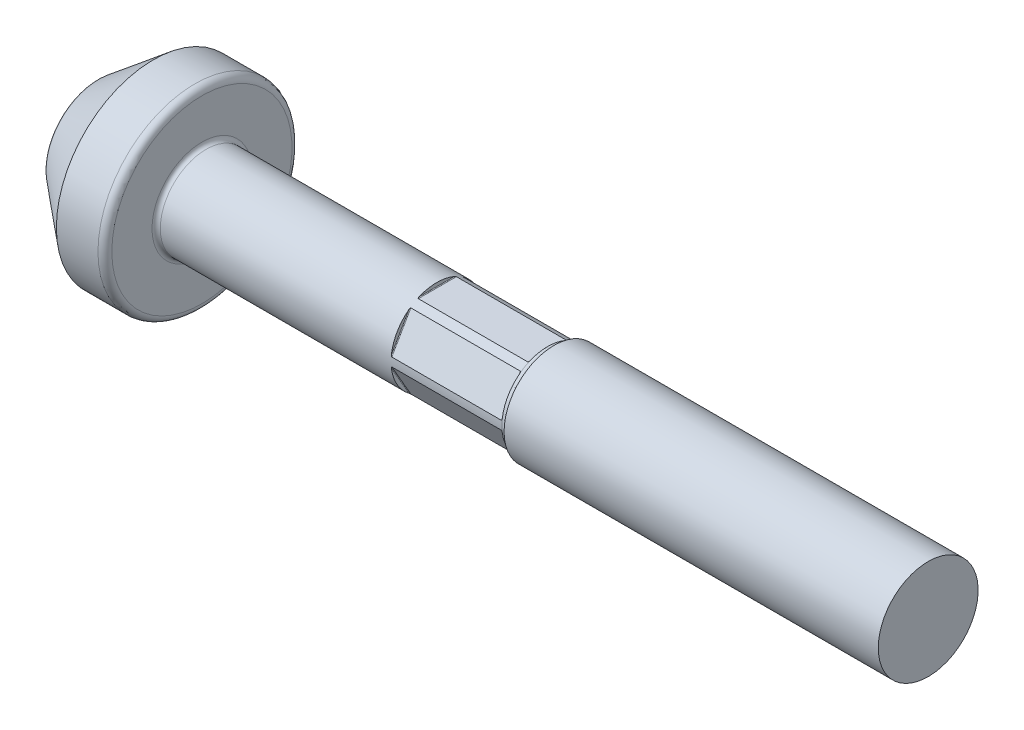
ISO-10303-21;
HEADER;
FILE_DESCRIPTION(('STEP AP214'),'2;1');
FILE_NAME('part.step','',(''),(''),'','','');
FILE_SCHEMA(('AUTOMOTIVE_DESIGN { 1 0 10303 214 1 1 1 1 }'));
ENDSEC;
DATA;
#1=APPLICATION_CONTEXT('core data for automotive mechanical design processes');
#2=APPLICATION_PROTOCOL_DEFINITION('international standard','automotive_design',2000,#1);
#3=PRODUCT_CONTEXT('',#1,'mechanical');
#4=PRODUCT('Part','Part','',(#3));
#5=PRODUCT_RELATED_PRODUCT_CATEGORY('part','',(#4));
#6=PRODUCT_DEFINITION_FORMATION('','',#4);
#7=PRODUCT_DEFINITION_CONTEXT('part definition',#1,'design');
#8=PRODUCT_DEFINITION('design','',#6,#7);
#9=PRODUCT_DEFINITION_SHAPE('','',#8);
#10=(LENGTH_UNIT() NAMED_UNIT(*) SI_UNIT(.MILLI.,.METRE.));
#11=(NAMED_UNIT(*) PLANE_ANGLE_UNIT() SI_UNIT($,.RADIAN.));
#12=(NAMED_UNIT(*) SI_UNIT($,.STERADIAN.) SOLID_ANGLE_UNIT());
#13=UNCERTAINTY_MEASURE_WITH_UNIT(LENGTH_MEASURE(1.E-05),#10,'distance_accuracy_value','');
#14=(GEOMETRIC_REPRESENTATION_CONTEXT(3) GLOBAL_UNCERTAINTY_ASSIGNED_CONTEXT((#13)) GLOBAL_UNIT_ASSIGNED_CONTEXT((#10,
#11,#12)) REPRESENTATION_CONTEXT('',''));
#15=CARTESIAN_POINT('',(0.,0.,0.));
#16=DIRECTION('',(0.,0.,1.));
#17=DIRECTION('',(1.,0.,0.));
#18=AXIS2_PLACEMENT_3D('',#15,#16,#17);
#19=CARTESIAN_POINT('',(0.,0.,0.));
#20=DIRECTION('',(1.,0.,0.));
#21=DIRECTION('',(0.,0.,-1.));
#22=AXIS2_PLACEMENT_3D('',#19,#20,#21);
#23=PLANE('',#22);
#24=CARTESIAN_POINT('',(0.,0.,0.));
#25=DIRECTION('',(-1.,0.,0.));
#26=DIRECTION('',(0.,0.,1.));
#27=AXIS2_PLACEMENT_3D('',#24,#25,#26);
#28=CIRCLE('',#27,34.4139769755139);
#29=CARTESIAN_POINT('',(0.,0.,34.4139769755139));
#30=VERTEX_POINT('',#29);
#31=EDGE_CURVE('E185',#30,#30,#28,.T.);
#32=ORIENTED_EDGE('',*,*,#31,.T.);
#33=EDGE_LOOP('',(#32));
#34=FACE_BOUND('',#33,.T.);
#35=ADVANCED_FACE('F45',(#34),#23,.F.);
#36=CARTESIAN_POINT('',(5.,0.,0.));
#37=DIRECTION('',(-1.,0.,0.));
#38=DIRECTION('',(0.,0.,1.));
#39=AXIS2_PLACEMENT_3D('',#36,#37,#38);
#40=TOROIDAL_SURFACE('',#39,34.4139769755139,5.);
#41=ORIENTED_EDGE('',*,*,#31,.F.);
#42=EDGE_LOOP('',(#41));
#43=FACE_BOUND('',#42,.T.);
#44=CARTESIAN_POINT('',(1.85339804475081,0.,0.));
#45=DIRECTION('',(-1.,0.,0.));
#46=DIRECTION('',(0.,0.,1.));
#47=AXIS2_PLACEMENT_3D('',#44,#45,#46);
#48=CIRCLE('',#47,38.2997067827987);
#49=CARTESIAN_POINT('',(1.85339804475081,0.,38.2997067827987));
#50=VERTEX_POINT('',#49);
#51=EDGE_CURVE('E182',#50,#50,#48,.T.);
#52=ORIENTED_EDGE('',*,*,#51,.T.);
#53=EDGE_LOOP('',(#52));
#54=FACE_BOUND('',#53,.T.);
#55=ADVANCED_FACE('F478',(#43,#54),#40,.T.);
#56=CARTESIAN_POINT('',(41.,0.,0.));
#57=DIRECTION('',(1.,0.,0.));
#58=DIRECTION('',(0.,0.,-1.));
#59=AXIS2_PLACEMENT_3D('',#56,#57,#58);
#60=CONICAL_SURFACE('',#59,70.,0.68067840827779);
#61=ORIENTED_EDGE('',*,*,#51,.F.);
#62=EDGE_LOOP('',(#61));
#63=FACE_BOUND('',#62,.T.);
#64=CARTESIAN_POINT('',(41.,0.,0.));
#65=DIRECTION('',(-1.,0.,0.));
#66=DIRECTION('',(0.,0.,1.));
#67=AXIS2_PLACEMENT_3D('',#64,#65,#66);
#68=CIRCLE('',#67,70.);
#69=CARTESIAN_POINT('',(41.,0.,70.));
#70=VERTEX_POINT('',#69);
#71=EDGE_CURVE('E179',#70,#70,#68,.T.);
#72=ORIENTED_EDGE('',*,*,#71,.T.);
#73=EDGE_LOOP('',(#72));
#74=FACE_BOUND('',#73,.T.);
#75=ADVANCED_FACE('F483',(#63,#74),#60,.T.);
#76=CARTESIAN_POINT('',(0.,0.,0.));
#77=DIRECTION('',(-1.,0.,0.));
#78=DIRECTION('',(0.,0.,1.));
#79=AXIS2_PLACEMENT_3D('',#76,#77,#78);
#80=CYLINDRICAL_SURFACE('',#79,70.);
#81=ORIENTED_EDGE('',*,*,#71,.F.);
#82=EDGE_LOOP('',(#81));
#83=FACE_BOUND('',#82,.T.);
#84=CARTESIAN_POINT('',(71.,0.,0.));
#85=DIRECTION('',(-1.,0.,0.));
#86=DIRECTION('',(0.,0.,1.));
#87=AXIS2_PLACEMENT_3D('',#84,#85,#86);
#88=CIRCLE('',#87,70.);
#89=CARTESIAN_POINT('',(71.,0.,70.));
#90=VERTEX_POINT('',#89);
#91=EDGE_CURVE('E176',#90,#90,#88,.T.);
#92=ORIENTED_EDGE('',*,*,#91,.T.);
#93=EDGE_LOOP('',(#92));
#94=FACE_BOUND('',#93,.T.);
#95=ADVANCED_FACE('F491',(#83,#94),#80,.T.);
#96=CARTESIAN_POINT('',(71.,0.,0.));
#97=DIRECTION('',(-1.,0.,0.));
#98=DIRECTION('',(0.,0.,1.));
#99=AXIS2_PLACEMENT_3D('',#96,#97,#98);
#100=TOROIDAL_SURFACE('',#99,65.,5.);
#101=ORIENTED_EDGE('',*,*,#91,.F.);
#102=EDGE_LOOP('',(#101));
#103=FACE_BOUND('',#102,.T.);
#104=CARTESIAN_POINT('',(76.,0.,0.));
#105=DIRECTION('',(-1.,0.,0.));
#106=DIRECTION('',(0.,0.,1.));
#107=AXIS2_PLACEMENT_3D('',#104,#105,#106);
#108=CIRCLE('',#107,65.);
#109=CARTESIAN_POINT('',(76.,0.,65.));
#110=VERTEX_POINT('',#109);
#111=EDGE_CURVE('E172',#110,#110,#108,.T.);
#112=ORIENTED_EDGE('',*,*,#111,.T.);
#113=EDGE_LOOP('',(#112));
#114=FACE_BOUND('',#113,.T.);
#115=ADVANCED_FACE('F497',(#103,#114),#100,.T.);
#116=CARTESIAN_POINT('',(76.,65.,0.));
#117=DIRECTION('',(-1.,0.,0.));
#118=DIRECTION('',(0.,0.,1.));
#119=AXIS2_PLACEMENT_3D('',#116,#117,#118);
#120=PLANE('',#119);
#121=CARTESIAN_POINT('',(76.,0.,0.));
#122=DIRECTION('',(-1.,0.,0.));
#123=DIRECTION('',(0.,0.,1.));
#124=AXIS2_PLACEMENT_3D('',#121,#122,#123);
#125=CIRCLE('',#124,36.);
#126=CARTESIAN_POINT('',(76.,0.,36.));
#127=VERTEX_POINT('',#126);
#128=EDGE_CURVE('E53',#127,#127,#125,.T.);
#129=ORIENTED_EDGE('',*,*,#128,.T.);
#130=EDGE_LOOP('',(#129));
#131=FACE_BOUND('',#130,.T.);
#132=ORIENTED_EDGE('',*,*,#111,.F.);
#133=EDGE_LOOP('',(#132));
#134=FACE_BOUND('',#133,.T.);
#135=ADVANCED_FACE('F468',(#131,#134),#120,.F.);
#136=CARTESIAN_POINT('',(0.,0.,0.));
#137=DIRECTION('',(-1.,0.,0.));
#138=DIRECTION('',(0.,0.,1.));
#139=AXIS2_PLACEMENT_3D('',#136,#137,#138);
#140=CYLINDRICAL_SURFACE('',#139,33.);
#141=CARTESIAN_POINT('',(79.,0.,0.));
#142=DIRECTION('',(-1.,0.,0.));
#143=DIRECTION('',(0.,0.,1.));
#144=AXIS2_PLACEMENT_3D('',#141,#142,#143);
#145=CIRCLE('',#144,33.);
#146=CARTESIAN_POINT('',(79.,0.,33.));
#147=VERTEX_POINT('',#146);
#148=EDGE_CURVE('E11',#147,#147,#145,.F.);
#149=ORIENTED_EDGE('',*,*,#148,.T.);
#150=EDGE_LOOP('',(#149));
#151=FACE_BOUND('',#150,.T.);
#152=CARTESIAN_POINT('',(325.417424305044,0.,0.));
#153=DIRECTION('',(-1.,0.,0.));
#154=DIRECTION('',(0.,0.,1.));
#155=AXIS2_PLACEMENT_3D('',#152,#153,#154);
#156=CIRCLE('',#155,33.);
#157=CARTESIAN_POINT('',(325.417424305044,-4.33842357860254,32.7135763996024));
#158=VERTEX_POINT('',#157);
#159=CARTESIAN_POINT('',(325.417424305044,4.33842357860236,32.7135763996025));
#160=VERTEX_POINT('',#159);
#161=EDGE_CURVE('E729',#158,#160,#156,.T.);
#162=ORIENTED_EDGE('',*,*,#161,.T.);
#163=CARTESIAN_POINT('',(325.417424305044,4.33842357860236,32.7135763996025));
#164=CARTESIAN_POINT('',(325.417393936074,4.27972955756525,32.7213611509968));
#165=CARTESIAN_POINT('',(325.415888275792,4.22099484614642,32.7289889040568));
#166=CARTESIAN_POINT('',(325.409594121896,4.10349458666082,32.7439282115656));
#167=CARTESIAN_POINT('',(325.404796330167,4.04472942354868,32.7512388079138));
#168=CARTESIAN_POINT('',(325.391586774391,3.92759534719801,32.7654921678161));
#169=CARTESIAN_POINT('',(325.383177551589,3.86922618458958,32.7724351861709));
#170=CARTESIAN_POINT('',(325.362147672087,3.75325212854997,32.7859191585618));
#171=CARTESIAN_POINT('',(325.349532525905,3.69564633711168,32.7924606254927));
#172=CARTESIAN_POINT('',(325.324954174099,3.60377970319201,32.80265249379));
#173=CARTESIAN_POINT('',(325.314622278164,3.56909854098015,32.8064433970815));
#174=CARTESIAN_POINT('',(325.291573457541,3.50039927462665,32.8138446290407));
#175=CARTESIAN_POINT('',(325.278850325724,3.46638315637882,32.8174544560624));
#176=CARTESIAN_POINT('',(325.248234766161,3.39418330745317,32.8250063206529));
#177=CARTESIAN_POINT('',(325.229840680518,3.35620530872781,32.8289088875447));
#178=CARTESIAN_POINT('',(325.187877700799,3.28320418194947,32.8362892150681));
#179=CARTESIAN_POINT('',(325.164335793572,3.24816691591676,32.8397690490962));
#180=CARTESIAN_POINT('',(325.126097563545,3.20314072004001,32.8441785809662));
#181=CARTESIAN_POINT('',(325.114437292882,3.19062153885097,32.845396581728));
#182=CARTESIAN_POINT('',(325.089694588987,3.16699266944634,32.8476832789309));
#183=CARTESIAN_POINT('',(325.07661017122,3.15588499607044,32.8487517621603));
#184=CARTESIAN_POINT('',(325.048697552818,3.13555383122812,32.8506987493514));
#185=CARTESIAN_POINT('',(325.033845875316,3.12636153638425,32.8515741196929));
#186=CARTESIAN_POINT('',(325.00266753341,3.11101484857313,32.8530310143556));
#187=CARTESIAN_POINT('',(324.986349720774,3.10484350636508,32.8536141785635));
#188=CARTESIAN_POINT('',(324.961057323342,3.09850229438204,32.8542126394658));
#189=CARTESIAN_POINT('',(324.95244195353,3.0968737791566,32.8543661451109));
#190=CARTESIAN_POINT('',(324.935030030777,3.09467584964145,32.8545732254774));
#191=CARTESIAN_POINT('',(324.926232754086,3.0941121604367,32.8546262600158));
#192=CARTESIAN_POINT('',(324.917424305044,3.09411910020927,32.8546256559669));
#193=B_SPLINE_CURVE_WITH_KNOTS('',3,(#163,#164,#165,#166,#167,#168,#169,#170,#171,#172,#173,
#174,#175,#176,#177,#178,#179,#180,#181,#182,#183,#184,#185,#186,#187,#188,#189,#190,#191,#192),
.UNSPECIFIED.,.F.,.F.,(4,2,2,2,2,2,2,2,2,2,2,2,2,2,4),(0.,0.177636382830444,0.355776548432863,
0.533791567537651,0.711574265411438,0.820667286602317,0.930047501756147,1.05695680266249,
1.18321609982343,1.23458380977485,1.28602403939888,1.33824594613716,1.39017140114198,
1.41641828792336,1.4428058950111),.UNSPECIFIED.);
#194=CARTESIAN_POINT('',(324.917424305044,3.09411910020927,32.8546256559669));
#195=VERTEX_POINT('',#194);
#196=EDGE_CURVE('E270',#160,#195,#193,.T.);
#197=ORIENTED_EDGE('',*,*,#196,.T.);
#198=DIRECTION('',(-1.,0.,0.));
#199=VECTOR('',#198,1.);
#200=CARTESIAN_POINT('',(0.,3.09411910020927,32.8546256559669));
#201=LINE('',#200,#199);
#202=CARTESIAN_POINT('',(245.917424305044,3.09411910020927,32.8546256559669));
#203=VERTEX_POINT('',#202);
#204=EDGE_CURVE('E153',#195,#203,#201,.T.);
#205=ORIENTED_EDGE('',*,*,#204,.T.);
#206=CARTESIAN_POINT('',(245.917424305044,3.09411910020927,32.8546256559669));
#207=CARTESIAN_POINT('',(245.904493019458,3.09408401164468,32.8546287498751));
#208=CARTESIAN_POINT('',(245.891608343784,3.09531619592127,32.8545129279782));
#209=CARTESIAN_POINT('',(245.866398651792,3.09998861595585,32.854072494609));
#210=CARTESIAN_POINT('',(245.854068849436,3.10340283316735,32.8537503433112));
#211=CARTESIAN_POINT('',(245.827202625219,3.11318796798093,32.8528246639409));
#212=CARTESIAN_POINT('',(245.81285970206,3.12007631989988,32.8521717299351));
#213=CARTESIAN_POINT('',(245.785429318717,3.13606550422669,32.8506492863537));
#214=CARTESIAN_POINT('',(245.772348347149,3.14517700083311,32.8497787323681));
#215=CARTESIAN_POINT('',(245.7397976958,3.17109140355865,32.8472896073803));
#216=CARTESIAN_POINT('',(245.721366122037,3.189171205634,32.8455409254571));
#217=CARTESIAN_POINT('',(245.687337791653,3.22775577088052,32.8417717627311));
#218=CARTESIAN_POINT('',(245.671746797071,3.24826532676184,32.839750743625));
#219=CARTESIAN_POINT('',(245.642695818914,3.29103975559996,32.8354918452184));
#220=CARTESIAN_POINT('',(245.629261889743,3.31332183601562,32.8332517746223));
#221=CARTESIAN_POINT('',(245.604295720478,3.35892332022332,32.828618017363));
#222=CARTESIAN_POINT('',(245.592765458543,3.38224377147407,32.8262241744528));
#223=CARTESIAN_POINT('',(245.571228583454,3.42973802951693,32.8212959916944));
#224=CARTESIAN_POINT('',(245.561232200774,3.45391634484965,32.818760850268));
#225=CARTESIAN_POINT('',(245.542619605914,3.50276791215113,32.8135828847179));
#226=CARTESIAN_POINT('',(245.534002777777,3.52744093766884,32.8109401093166));
#227=CARTESIAN_POINT('',(245.50510911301,3.61690291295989,32.8012533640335));
#228=CARTESIAN_POINT('',(245.48821630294,3.68276085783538,32.7939281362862));
#229=CARTESIAN_POINT('',(245.460362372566,3.81573861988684,32.7787224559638));
#230=CARTESIAN_POINT('',(245.449415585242,3.88286108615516,32.7708407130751));
#231=CARTESIAN_POINT('',(245.432815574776,4.01483001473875,32.7549289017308));
#232=CARTESIAN_POINT('',(245.426959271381,4.07965361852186,32.7469189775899));
#233=CARTESIAN_POINT('',(245.421191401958,4.17684732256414,32.7346148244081));
#234=CARTESIAN_POINT('',(245.419771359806,4.20915760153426,32.7304759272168));
#235=CARTESIAN_POINT('',(245.417888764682,4.27378794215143,32.7220995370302));
#236=CARTESIAN_POINT('',(245.417426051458,4.30610800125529,32.7178620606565));
#237=CARTESIAN_POINT('',(245.417424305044,4.33842357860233,32.7135763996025));
#238=B_SPLINE_CURVE_WITH_KNOTS('',3,(#206,#207,#208,#209,#210,#211,#212,#213,#214,#215,#216,
#217,#218,#219,#220,#221,#222,#223,#224,#225,#226,#227,#228,#229,#230,#231,#232,#233,#234,#235,
#236,#237),.UNSPECIFIED.,.F.,.F.,(4,2,2,2,2,2,2,2,2,2,2,2,2,2,2,4),(0.,0.0386595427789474,
0.0768664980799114,0.124374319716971,0.172114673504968,0.249311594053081,0.326663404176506,
0.404888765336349,0.483194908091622,0.562002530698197,0.640774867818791,0.845488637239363,
1.05069370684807,1.24727731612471,1.3450816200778,1.4428695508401),.UNSPECIFIED.);
#239=CARTESIAN_POINT('',(245.417424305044,4.33842357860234,32.7135763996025));
#240=VERTEX_POINT('',#239);
#241=EDGE_CURVE('E284',#203,#240,#238,.T.);
#242=ORIENTED_EDGE('',*,*,#241,.T.);
#243=CARTESIAN_POINT('',(245.417424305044,0.,0.));
#244=DIRECTION('',(-1.,0.,0.));
#245=DIRECTION('',(0.,0.,1.));
#246=AXIS2_PLACEMENT_3D('',#243,#244,#245);
#247=CIRCLE('',#246,33.);
#248=CARTESIAN_POINT('',(245.417424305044,26.1615764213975,20.1139732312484));
#249=VERTEX_POINT('',#248);
#250=EDGE_CURVE('E257',#240,#249,#247,.T.);
#251=ORIENTED_EDGE('',*,*,#250,.T.);
#252=CARTESIAN_POINT('',(245.417424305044,26.1615764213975,20.1139732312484));
#253=CARTESIAN_POINT('',(245.417454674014,26.1976652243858,20.0670350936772));
#254=CARTESIAN_POINT('',(245.418960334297,26.2336384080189,20.0199832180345));
#255=CARTESIAN_POINT('',(245.425254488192,26.3053263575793,19.9256946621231));
#256=CARTESIAN_POINT('',(245.430052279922,26.3410401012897,19.8784578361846));
#257=CARTESIAN_POINT('',(245.443261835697,26.4119509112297,19.7841434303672));
#258=CARTESIAN_POINT('',(245.451671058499,26.4471483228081,19.7370657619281));
#259=CARTESIAN_POINT('',(245.472700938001,26.5168128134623,19.6433712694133));
#260=CARTESIAN_POINT('',(245.485316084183,26.5512807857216,19.5967539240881));
#261=CARTESIAN_POINT('',(245.509894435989,26.606040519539,19.5222910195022));
#262=CARTESIAN_POINT('',(245.520226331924,26.6266641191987,19.4941517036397));
#263=CARTESIAN_POINT('',(245.543275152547,26.6674234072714,19.4383570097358));
#264=CARTESIAN_POINT('',(245.555998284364,26.6875576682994,19.4107031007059));
#265=CARTESIAN_POINT('',(245.586613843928,26.7301976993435,19.3519521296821));
#266=CARTESIAN_POINT('',(245.605007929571,26.7525664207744,19.321013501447));
#267=CARTESIAN_POINT('',(245.64697090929,26.7954585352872,19.2614828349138));
#268=CARTESIAN_POINT('',(245.670512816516,26.8159907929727,19.2328795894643));
#269=CARTESIAN_POINT('',(245.708751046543,26.8423226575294,19.1960905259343));
#270=CARTESIAN_POINT('',(245.720411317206,26.8496370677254,19.1858575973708));
#271=CARTESIAN_POINT('',(245.745154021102,26.8634318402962,19.1665377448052));
#272=CARTESIAN_POINT('',(245.758238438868,26.8699110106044,19.1574524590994));
#273=CARTESIAN_POINT('',(245.78615105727,26.8817627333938,19.140818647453));
#274=CARTESIAN_POINT('',(245.801002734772,26.8871169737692,19.1332955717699));
#275=CARTESIAN_POINT('',(245.832181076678,26.8960520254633,19.1207333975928));
#276=CARTESIAN_POINT('',(245.848498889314,26.899642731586,19.1156804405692));
#277=CARTESIAN_POINT('',(245.873791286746,26.903331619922,19.1104880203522));
#278=CARTESIAN_POINT('',(245.882406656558,26.904278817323,19.1091544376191));
#279=CARTESIAN_POINT('',(245.899818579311,26.9055571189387,19.1073545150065));
#280=CARTESIAN_POINT('',(245.908615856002,26.9058848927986,19.1068928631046));
#281=CARTESIAN_POINT('',(245.917424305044,26.9058808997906,19.1068985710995));
#282=B_SPLINE_CURVE_WITH_KNOTS('',3,(#252,#253,#254,#255,#256,#257,#258,#259,#260,#261,#262,
#263,#264,#265,#266,#267,#268,#269,#270,#271,#272,#273,#274,#275,#276,#277,#278,#279,#280,#281),
.UNSPECIFIED.,.F.,.F.,(4,2,2,2,2,2,2,2,2,2,2,2,2,2,4),(0.,0.177636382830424,0.355776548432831,
0.533791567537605,0.711574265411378,0.82066728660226,0.930047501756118,1.05695680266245,
1.18321609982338,1.23458380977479,1.28602403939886,1.33824594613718,1.39017140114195,
1.41641828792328,1.44280589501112),.UNSPECIFIED.);
#283=CARTESIAN_POINT('',(245.917424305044,26.9058808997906,19.1068985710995));
#284=VERTEX_POINT('',#283);
#285=EDGE_CURVE('E291',#249,#284,#282,.T.);
#286=ORIENTED_EDGE('',*,*,#285,.T.);
#287=DIRECTION('',(-1.,0.,0.));
#288=VECTOR('',#287,1.);
#289=CARTESIAN_POINT('',(0.,26.9058808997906,19.1068985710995));
#290=LINE('',#289,#288);
#291=CARTESIAN_POINT('',(324.917424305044,26.9058808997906,19.1068985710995));
#292=VERTEX_POINT('',#291);
#293=EDGE_CURVE('E150',#284,#292,#290,.F.);
#294=ORIENTED_EDGE('',*,*,#293,.T.);
#295=CARTESIAN_POINT('',(324.917424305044,26.9058808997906,19.1068985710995));
#296=CARTESIAN_POINT('',(324.93035559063,26.905901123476,19.1068697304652));
#297=CARTESIAN_POINT('',(324.943240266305,26.9051847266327,19.1078789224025));
#298=CARTESIAN_POINT('',(324.968449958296,26.902467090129,19.111705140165));
#299=CARTESIAN_POINT('',(324.980779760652,26.9004809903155,19.1145008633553));
#300=CARTESIAN_POINT('',(325.007645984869,26.8947867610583,19.1225121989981));
#301=CARTESIAN_POINT('',(325.021988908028,26.8907771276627,19.1281512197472));
#302=CARTESIAN_POINT('',(325.049419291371,26.881464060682,19.1412370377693));
#303=CARTESIAN_POINT('',(325.062500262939,26.8761543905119,19.1486925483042));
#304=CARTESIAN_POINT('',(325.095050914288,26.8610415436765,19.1698905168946));
#305=CARTESIAN_POINT('',(325.113482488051,26.8504872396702,19.1846737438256));
#306=CARTESIAN_POINT('',(325.147510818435,26.8279307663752,19.2162043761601));
#307=CARTESIAN_POINT('',(325.163101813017,26.8159257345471,19.2329556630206));
#308=CARTESIAN_POINT('',(325.192152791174,26.7908502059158,19.2678699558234));
#309=CARTESIAN_POINT('',(325.205586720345,26.7777692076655,19.2860467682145));
#310=CARTESIAN_POINT('',(325.23055288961,26.7509555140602,19.323221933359));
#311=CARTESIAN_POINT('',(325.242083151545,26.7372221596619,19.3422211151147));
#312=CARTESIAN_POINT('',(325.263620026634,26.7092070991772,19.3808882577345));
#313=CARTESIAN_POINT('',(325.273616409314,26.6949224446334,19.4005597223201));
#314=CARTESIAN_POINT('',(325.292229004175,26.6660124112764,19.4402774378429));
#315=CARTESIAN_POINT('',(325.300845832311,26.6513871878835,19.4603235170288));
#316=CARTESIAN_POINT('',(325.329739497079,26.5982672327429,19.532956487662));
#317=CARTESIAN_POINT('',(325.346632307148,26.5589944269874,19.5863285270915));
#318=CARTESIAN_POINT('',(325.374486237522,26.4793370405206,19.6938878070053));
#319=CARTESIAN_POINT('',(325.385433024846,26.4389500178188,19.748076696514));
#320=CARTESIAN_POINT('',(325.402033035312,26.3591855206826,19.8544092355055));
#321=CARTESIAN_POINT('',(325.407889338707,26.3198369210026,19.9065431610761));
#322=CARTESIAN_POINT('',(325.41365720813,26.2605843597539,19.9845633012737));
#323=CARTESIAN_POINT('',(325.415077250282,26.2408448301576,20.0104753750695));
#324=CARTESIAN_POINT('',(325.416959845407,26.2012754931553,20.062258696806));
#325=CARTESIAN_POINT('',(325.41742255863,26.1814457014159,20.0881299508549));
#326=CARTESIAN_POINT('',(325.417424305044,26.1615764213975,20.1139732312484));
#327=B_SPLINE_CURVE_WITH_KNOTS('',3,(#295,#296,#297,#298,#299,#300,#301,#302,#303,#304,#305,
#306,#307,#308,#309,#310,#311,#312,#313,#314,#315,#316,#317,#318,#319,#320,#321,#322,#323,#324,
#325,#326),.UNSPECIFIED.,.F.,.F.,(4,2,2,2,2,2,2,2,2,2,2,2,2,2,2,4),(0.,0.0386595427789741,
0.0768664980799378,0.124374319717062,0.172114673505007,0.249311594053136,0.326663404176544,
0.404888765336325,0.483194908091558,0.562002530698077,0.640774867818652,0.845488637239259,
1.05069370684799,1.24727731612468,1.3450816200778,1.44286955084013),.UNSPECIFIED.);
#328=CARTESIAN_POINT('',(325.417424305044,26.1615764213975,20.1139732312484));
#329=VERTEX_POINT('',#328);
#330=EDGE_CURVE('E277',#292,#329,#327,.T.);
#331=ORIENTED_EDGE('',*,*,#330,.T.);
#332=CARTESIAN_POINT('',(325.417424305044,30.5,12.5996031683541));
#333=VERTEX_POINT('',#332);
#334=EDGE_CURVE('E168',#329,#333,#156,.T.);
#335=ORIENTED_EDGE('',*,*,#334,.T.);
#336=CARTESIAN_POINT('',(325.417424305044,30.5,12.5996031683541));
#337=CARTESIAN_POINT('',(325.417393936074,30.4773947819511,12.6543260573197));
#338=CARTESIAN_POINT('',(325.415888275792,30.4546332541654,12.7090056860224));
#339=CARTESIAN_POINT('',(325.409594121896,30.4088209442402,12.8182335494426));
#340=CARTESIAN_POINT('',(325.404796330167,30.3857695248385,12.8727809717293));
#341=CARTESIAN_POINT('',(325.391586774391,30.3395462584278,12.9813487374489));
#342=CARTESIAN_POINT('',(325.383177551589,30.3163745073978,13.0353694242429));
#343=CARTESIAN_POINT('',(325.362147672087,30.2700649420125,13.1425478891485));
#344=CARTESIAN_POINT('',(325.349532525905,30.2469271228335,13.1957067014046));
#345=CARTESIAN_POINT('',(325.324954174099,30.2098202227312,13.2803614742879));
#346=CARTESIAN_POINT('',(325.314622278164,30.195762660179,13.3122916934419));
#347=CARTESIAN_POINT('',(325.291573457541,30.1678226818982,13.375487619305));
#348=CARTESIAN_POINT('',(325.278850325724,30.1539408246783,13.4067513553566));
#349=CARTESIAN_POINT('',(325.248234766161,30.1243810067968,13.4730541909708));
#350=CARTESIAN_POINT('',(325.229840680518,30.1087717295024,13.5078953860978));
#351=CARTESIAN_POINT('',(325.187877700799,30.0786627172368,13.5748063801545));
#352=CARTESIAN_POINT('',(325.164335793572,30.0641577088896,13.6068894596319));
#353=CARTESIAN_POINT('',(325.126097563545,30.0454633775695,13.648088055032));
#354=CARTESIAN_POINT('',(325.114437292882,30.0402586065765,13.6595389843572));
#355=CARTESIAN_POINT('',(325.089694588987,30.0304245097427,13.6811455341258));
#356=CARTESIAN_POINT('',(325.07661017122,30.0257960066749,13.6912993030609));
#357=CARTESIAN_POINT('',(325.048697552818,30.0173165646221,13.7098801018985));
#358=CARTESIAN_POINT('',(325.033845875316,30.0134785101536,13.7182785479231));
#359=CARTESIAN_POINT('',(325.00266753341,30.0070668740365,13.7322976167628));
#360=CARTESIAN_POINT('',(324.986349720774,30.0044862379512,13.7379337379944));
#361=CARTESIAN_POINT('',(324.961057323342,30.0018339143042,13.7437246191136));
#362=CARTESIAN_POINT('',(324.95244195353,30.0011525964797,13.7452117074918));
#363=CARTESIAN_POINT('',(324.935030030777,30.0002329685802,13.747218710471));
#364=CARTESIAN_POINT('',(324.926232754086,29.9999970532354,13.7477333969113));
#365=CARTESIAN_POINT('',(324.917424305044,30.,13.7477270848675));
#366=B_SPLINE_CURVE_WITH_KNOTS('',3,(#336,#337,#338,#339,#340,#341,#342,#343,#344,#345,#346,
#347,#348,#349,#350,#351,#352,#353,#354,#355,#356,#357,#358,#359,#360,#361,#362,#363,#364,#365),
.UNSPECIFIED.,.F.,.F.,(4,2,2,2,2,2,2,2,2,2,2,2,2,2,4),(0.,0.177636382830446,0.355776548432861,
0.533791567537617,0.711574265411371,0.820667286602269,0.93004750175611,1.05695680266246,
1.18321609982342,1.23458380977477,1.28602403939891,1.3382459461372,1.39017140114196,
1.41641828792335,1.44280589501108),.UNSPECIFIED.);
#367=CARTESIAN_POINT('',(324.917424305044,30.,13.7477270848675));
#368=VERTEX_POINT('',#367);
#369=EDGE_CURVE('E203',#333,#368,#366,.T.);
#370=ORIENTED_EDGE('',*,*,#369,.T.);
#371=DIRECTION('',(-1.,0.,0.));
#372=VECTOR('',#371,1.);
#373=CARTESIAN_POINT('',(0.,30.,13.7477270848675));
#374=LINE('',#373,#372);
#375=CARTESIAN_POINT('',(245.917424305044,30.,13.7477270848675));
#376=VERTEX_POINT('',#375);
#377=EDGE_CURVE('E159',#368,#376,#374,.T.);
#378=ORIENTED_EDGE('',*,*,#377,.T.);
#379=CARTESIAN_POINT('',(245.917424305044,30.,13.7477270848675));
#380=CARTESIAN_POINT('',(245.904493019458,29.9999851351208,13.7477590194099));
#381=CARTESIAN_POINT('',(245.891608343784,30.0005009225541,13.7466340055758));
#382=CARTESIAN_POINT('',(245.866398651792,30.0024557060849,13.7423673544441));
#383=CARTESIAN_POINT('',(245.854068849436,30.0038838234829,13.739249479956));
#384=CARTESIAN_POINT('',(245.827202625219,30.0079747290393,13.7303124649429));
#385=CARTESIAN_POINT('',(245.81285970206,30.0108534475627,13.724020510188));
#386=CARTESIAN_POINT('',(245.785429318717,30.0175295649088,13.7094122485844));
#387=CARTESIAN_POINT('',(245.772348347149,30.0213313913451,13.7010861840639));
#388=CARTESIAN_POINT('',(245.7397976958,30.0321329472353,13.6773990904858));
#389=CARTESIAN_POINT('',(245.721366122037,30.0396584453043,13.6608671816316));
#390=CARTESIAN_POINT('',(245.687337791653,30.0556865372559,13.6255673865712));
#391=CARTESIAN_POINT('',(245.671746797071,30.0641910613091,13.6067950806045));
#392=CARTESIAN_POINT('',(245.642695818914,30.0818899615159,13.567621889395));
#393=CARTESIAN_POINT('',(245.629261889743,30.0910910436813,13.5472050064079));
#394=CARTESIAN_POINT('',(245.604295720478,30.1098788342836,13.5053960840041));
#395=CARTESIAN_POINT('',(245.592765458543,30.1194659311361,13.4840030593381));
#396=CARTESIAN_POINT('',(245.571228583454,30.1389451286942,13.4404077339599));
#397=CARTESIAN_POINT('',(245.561232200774,30.1488387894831,13.4182011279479));
#398=CARTESIAN_POINT('',(245.542619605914,30.1687803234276,13.3733054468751));
#399=CARTESIAN_POINT('',(245.534002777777,30.1788281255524,13.3506165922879));
#400=CARTESIAN_POINT('',(245.50510911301,30.2151701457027,13.2682968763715));
#401=CARTESIAN_POINT('',(245.48821630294,30.2417552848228,13.2075996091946));
#402=CARTESIAN_POINT('',(245.460362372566,30.2950756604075,13.0848346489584));
#403=CARTESIAN_POINT('',(245.449415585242,30.321811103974,13.0227640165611));
#404=CARTESIAN_POINT('',(245.432815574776,30.3740155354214,12.9005196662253));
#405=CARTESIAN_POINT('',(245.426959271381,30.3994905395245,12.8403758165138));
#406=CARTESIAN_POINT('',(245.421191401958,30.4374316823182,12.7500515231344));
#407=CARTESIAN_POINT('',(245.419771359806,30.4500024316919,12.7200005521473));
#408=CARTESIAN_POINT('',(245.417888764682,30.4750634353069,12.6598408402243));
#409=CARTESIAN_POINT('',(245.417426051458,30.4875537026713,12.6297321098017));
#410=CARTESIAN_POINT('',(245.417424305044,30.5,12.5996031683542));
#411=B_SPLINE_CURVE_WITH_KNOTS('',3,(#379,#380,#381,#382,#383,#384,#385,#386,#387,#388,#389,
#390,#391,#392,#393,#394,#395,#396,#397,#398,#399,#400,#401,#402,#403,#404,#405,#406,#407,#408,
#409,#410),.UNSPECIFIED.,.F.,.F.,(4,2,2,2,2,2,2,2,2,2,2,2,2,2,2,4),(0.,0.0386595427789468,
0.0768664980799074,0.124374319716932,0.17211467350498,0.249311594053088,0.326663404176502,
0.404888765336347,0.483194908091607,0.562002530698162,0.640774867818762,0.845488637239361,
1.0506937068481,1.24727731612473,1.34508162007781,1.44286955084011),.UNSPECIFIED.);
#412=CARTESIAN_POINT('',(245.417424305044,30.5,12.5996031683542));
#413=VERTEX_POINT('',#412);
#414=EDGE_CURVE('E240',#376,#413,#411,.T.);
#415=ORIENTED_EDGE('',*,*,#414,.T.);
#416=CARTESIAN_POINT('',(245.417424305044,0.,0.));
#417=DIRECTION('',(-1.,0.,0.));
#418=DIRECTION('',(0.,0.,1.));
#419=AXIS2_PLACEMENT_3D('',#416,#417,#418);
#420=CIRCLE('',#419,33.);
#421=CARTESIAN_POINT('',(245.417424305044,30.5,-12.5996031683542));
#422=VERTEX_POINT('',#421);
#423=EDGE_CURVE('E188',#413,#422,#420,.T.);
#424=ORIENTED_EDGE('',*,*,#423,.T.);
#425=CARTESIAN_POINT('',(245.417424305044,30.5,-12.5996031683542));
#426=CARTESIAN_POINT('',(245.417454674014,30.4773947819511,-12.6543260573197));
#427=CARTESIAN_POINT('',(245.418960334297,30.4546332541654,-12.7090056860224));
#428=CARTESIAN_POINT('',(245.425254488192,30.4088209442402,-12.8182335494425));
#429=CARTESIAN_POINT('',(245.430052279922,30.3857695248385,-12.8727809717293));
#430=CARTESIAN_POINT('',(245.443261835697,30.3395462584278,-12.9813487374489));
#431=CARTESIAN_POINT('',(245.451671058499,30.3163745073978,-13.0353694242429));
#432=CARTESIAN_POINT('',(245.472700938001,30.2700649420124,-13.1425478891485));
#433=CARTESIAN_POINT('',(245.485316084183,30.2469271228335,-13.1957067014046));
#434=CARTESIAN_POINT('',(245.509894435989,30.2098202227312,-13.2803614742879));
#435=CARTESIAN_POINT('',(245.520226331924,30.195762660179,-13.3122916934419));
#436=CARTESIAN_POINT('',(245.543275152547,30.1678226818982,-13.375487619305));
#437=CARTESIAN_POINT('',(245.555998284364,30.1539408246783,-13.4067513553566));
#438=CARTESIAN_POINT('',(245.586613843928,30.1243810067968,-13.4730541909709));
#439=CARTESIAN_POINT('',(245.605007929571,30.1087717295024,-13.5078953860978));
#440=CARTESIAN_POINT('',(245.64697090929,30.0786627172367,-13.5748063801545));
#441=CARTESIAN_POINT('',(245.670512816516,30.0641577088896,-13.606889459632));
#442=CARTESIAN_POINT('',(245.708751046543,30.0454633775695,-13.6480880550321));
#443=CARTESIAN_POINT('',(245.720411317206,30.0402586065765,-13.6595389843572));
#444=CARTESIAN_POINT('',(245.745154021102,30.0304245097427,-13.6811455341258));
#445=CARTESIAN_POINT('',(245.758238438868,30.0257960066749,-13.6912993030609));
#446=CARTESIAN_POINT('',(245.78615105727,30.0173165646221,-13.7098801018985));
#447=CARTESIAN_POINT('',(245.801002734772,30.0134785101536,-13.7182785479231));
#448=CARTESIAN_POINT('',(245.832181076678,30.0070668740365,-13.7322976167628));
#449=CARTESIAN_POINT('',(245.848498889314,30.0044862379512,-13.7379337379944));
#450=CARTESIAN_POINT('',(245.873791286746,30.0018339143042,-13.7437246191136));
#451=CARTESIAN_POINT('',(245.882406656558,30.0011525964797,-13.7452117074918));
#452=CARTESIAN_POINT('',(245.899818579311,30.0002329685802,-13.747218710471));
#453=CARTESIAN_POINT('',(245.908615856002,29.9999970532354,-13.7477333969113));
#454=CARTESIAN_POINT('',(245.917424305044,30.,-13.7477270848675));
#455=B_SPLINE_CURVE_WITH_KNOTS('',3,(#425,#426,#427,#428,#429,#430,#431,#432,#433,#434,#435,
#436,#437,#438,#439,#440,#441,#442,#443,#444,#445,#446,#447,#448,#449,#450,#451,#452,#453,#454),
.UNSPECIFIED.,.F.,.F.,(4,2,2,2,2,2,2,2,2,2,2,2,2,2,4),(0.,0.177636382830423,0.355776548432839,
0.533791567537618,0.711574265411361,0.820667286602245,0.930047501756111,1.05695680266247,
1.18321609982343,1.23458380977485,1.28602403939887,1.33824594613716,1.39017140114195,
1.41641828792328,1.4428058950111),.UNSPECIFIED.);
#456=CARTESIAN_POINT('',(245.917424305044,30.,-13.7477270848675));
#457=VERTEX_POINT('',#456);
#458=EDGE_CURVE('E246',#422,#457,#455,.T.);
#459=ORIENTED_EDGE('',*,*,#458,.T.);
#460=DIRECTION('',(-1.,0.,0.));
#461=VECTOR('',#460,1.);
#462=CARTESIAN_POINT('',(0.,30.,-13.7477270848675));
#463=LINE('',#462,#461);
#464=CARTESIAN_POINT('',(324.917424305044,30.,-13.7477270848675));
#465=VERTEX_POINT('',#464);
#466=EDGE_CURVE('E156',#457,#465,#463,.F.);
#467=ORIENTED_EDGE('',*,*,#466,.T.);
#468=CARTESIAN_POINT('',(324.917424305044,30.,-13.7477270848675));
#469=CARTESIAN_POINT('',(324.93035559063,29.9999851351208,-13.7477590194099));
#470=CARTESIAN_POINT('',(324.943240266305,30.0005009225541,-13.7466340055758));
#471=CARTESIAN_POINT('',(324.968449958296,30.0024557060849,-13.7423673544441));
#472=CARTESIAN_POINT('',(324.980779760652,30.0038838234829,-13.739249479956));
#473=CARTESIAN_POINT('',(325.007645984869,30.0079747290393,-13.7303124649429));
#474=CARTESIAN_POINT('',(325.021988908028,30.0108534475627,-13.7240205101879));
#475=CARTESIAN_POINT('',(325.049419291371,30.0175295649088,-13.7094122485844));
#476=CARTESIAN_POINT('',(325.062500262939,30.0213313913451,-13.7010861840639));
#477=CARTESIAN_POINT('',(325.095050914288,30.0321329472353,-13.6773990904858));
#478=CARTESIAN_POINT('',(325.113482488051,30.0396584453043,-13.6608671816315));
#479=CARTESIAN_POINT('',(325.147510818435,30.0556865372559,-13.625567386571));
#480=CARTESIAN_POINT('',(325.163101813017,30.0641910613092,-13.6067950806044));
#481=CARTESIAN_POINT('',(325.192152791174,30.081889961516,-13.5676218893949));
#482=CARTESIAN_POINT('',(325.205586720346,30.0910910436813,-13.5472050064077));
#483=CARTESIAN_POINT('',(325.230552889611,30.1098788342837,-13.5053960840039));
#484=CARTESIAN_POINT('',(325.242083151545,30.1194659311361,-13.484003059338));
#485=CARTESIAN_POINT('',(325.263620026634,30.1389451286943,-13.4404077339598));
#486=CARTESIAN_POINT('',(325.273616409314,30.1488387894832,-13.4182011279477));
#487=CARTESIAN_POINT('',(325.292229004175,30.1687803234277,-13.3733054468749));
#488=CARTESIAN_POINT('',(325.300845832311,30.1788281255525,-13.3506165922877));
#489=CARTESIAN_POINT('',(325.329739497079,30.2151701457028,-13.2682968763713));
#490=CARTESIAN_POINT('',(325.346632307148,30.2417552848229,-13.2075996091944));
#491=CARTESIAN_POINT('',(325.374486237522,30.2950756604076,-13.0848346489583));
#492=CARTESIAN_POINT('',(325.385433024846,30.3218111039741,-13.0227640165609));
#493=CARTESIAN_POINT('',(325.402033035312,30.3740155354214,-12.9005196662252));
#494=CARTESIAN_POINT('',(325.407889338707,30.3994905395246,-12.8403758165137));
#495=CARTESIAN_POINT('',(325.41365720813,30.4374316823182,-12.7500515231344));
#496=CARTESIAN_POINT('',(325.415077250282,30.4500024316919,-12.7200005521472));
#497=CARTESIAN_POINT('',(325.416959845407,30.4750634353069,-12.6598408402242));
#498=CARTESIAN_POINT('',(325.41742255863,30.4875537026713,-12.6297321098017));
#499=CARTESIAN_POINT('',(325.417424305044,30.5,-12.5996031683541));
#500=B_SPLINE_CURVE_WITH_KNOTS('',3,(#468,#469,#470,#471,#472,#473,#474,#475,#476,#477,#478,
#479,#480,#481,#482,#483,#484,#485,#486,#487,#488,#489,#490,#491,#492,#493,#494,#495,#496,#497,
#498,#499),.UNSPECIFIED.,.F.,.F.,(4,2,2,2,2,2,2,2,2,2,2,2,2,2,2,4),(0.,0.0386595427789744,
0.0768664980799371,0.124374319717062,0.172114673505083,0.249311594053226,0.326663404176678,
0.404888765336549,0.483194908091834,0.562002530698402,0.64077486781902,0.845488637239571,
1.05069370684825,1.24727731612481,1.34508162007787,1.44286955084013),.UNSPECIFIED.);
#501=CARTESIAN_POINT('',(325.417424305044,30.5,-12.5996031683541));
#502=VERTEX_POINT('',#501);
#503=EDGE_CURVE('E212',#465,#502,#500,.T.);
#504=ORIENTED_EDGE('',*,*,#503,.T.);
#505=CARTESIAN_POINT('',(325.417424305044,26.1615764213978,-20.113973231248));
#506=VERTEX_POINT('',#505);
#507=EDGE_CURVE('E82',#502,#506,#156,.T.);
#508=ORIENTED_EDGE('',*,*,#507,.T.);
#509=CARTESIAN_POINT('',(325.417424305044,26.1615764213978,-20.113973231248));
#510=CARTESIAN_POINT('',(325.417393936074,26.197665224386,-20.0670350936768));
#511=CARTESIAN_POINT('',(325.415888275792,26.2336384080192,-20.0199832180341));
#512=CARTESIAN_POINT('',(325.409594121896,26.3053263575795,-19.9256946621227));
#513=CARTESIAN_POINT('',(325.404796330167,26.34104010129,-19.8784578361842));
#514=CARTESIAN_POINT('',(325.391586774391,26.4119509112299,-19.7841434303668));
#515=CARTESIAN_POINT('',(325.383177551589,26.4471483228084,-19.7370657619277));
#516=CARTESIAN_POINT('',(325.362147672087,26.5168128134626,-19.643371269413));
#517=CARTESIAN_POINT('',(325.349532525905,26.5512807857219,-19.5967539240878));
#518=CARTESIAN_POINT('',(325.324954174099,26.6060405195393,-19.5222910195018));
#519=CARTESIAN_POINT('',(325.314622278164,26.6266641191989,-19.4941517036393));
#520=CARTESIAN_POINT('',(325.291573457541,26.6674234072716,-19.4383570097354));
#521=CARTESIAN_POINT('',(325.278850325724,26.6875576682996,-19.4107031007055));
#522=CARTESIAN_POINT('',(325.248234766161,26.7301976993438,-19.3519521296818));
#523=CARTESIAN_POINT('',(325.229840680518,26.7525664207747,-19.3210135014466));
#524=CARTESIAN_POINT('',(325.187877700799,26.7954585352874,-19.2614828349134));
#525=CARTESIAN_POINT('',(325.164335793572,26.815990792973,-19.232879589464));
#526=CARTESIAN_POINT('',(325.126097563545,26.8423226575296,-19.1960905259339));
#527=CARTESIAN_POINT('',(325.114437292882,26.8496370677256,-19.1858575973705));
#528=CARTESIAN_POINT('',(325.089694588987,26.8634318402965,-19.1665377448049));
#529=CARTESIAN_POINT('',(325.07661017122,26.8699110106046,-19.1574524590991));
#530=CARTESIAN_POINT('',(325.048697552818,26.8817627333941,-19.1408186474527));
#531=CARTESIAN_POINT('',(325.033845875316,26.8871169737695,-19.1332955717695));
#532=CARTESIAN_POINT('',(325.00266753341,26.8960520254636,-19.1207333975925));
#533=CARTESIAN_POINT('',(324.986349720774,26.8996427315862,-19.1156804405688));
#534=CARTESIAN_POINT('',(324.961057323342,26.9033316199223,-19.1104880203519));
#535=CARTESIAN_POINT('',(324.95244195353,26.9042788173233,-19.1091544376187));
#536=CARTESIAN_POINT('',(324.935030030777,26.9055571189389,-19.1073545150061));
#537=CARTESIAN_POINT('',(324.926232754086,26.9058848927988,-19.1068928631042));
#538=CARTESIAN_POINT('',(324.917424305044,26.9058808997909,-19.1068985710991));
#539=B_SPLINE_CURVE_WITH_KNOTS('',3,(#509,#510,#511,#512,#513,#514,#515,#516,#517,#518,#519,
#520,#521,#522,#523,#524,#525,#526,#527,#528,#529,#530,#531,#532,#533,#534,#535,#536,#537,#538),
.UNSPECIFIED.,.F.,.F.,(4,2,2,2,2,2,2,2,2,2,2,2,2,2,4),(0.,0.177636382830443,0.355776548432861,
0.533791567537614,0.711574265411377,0.820667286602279,0.930047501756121,1.0569568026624,
1.18321609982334,1.23458380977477,1.28602403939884,1.33824594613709,1.39017140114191,
1.41641828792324,1.44280589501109),.UNSPECIFIED.);
#540=CARTESIAN_POINT('',(324.917424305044,26.9058808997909,-19.1068985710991));
#541=VERTEX_POINT('',#540);
#542=EDGE_CURVE('E128',#506,#541,#539,.T.);
#543=ORIENTED_EDGE('',*,*,#542,.T.);
#544=DIRECTION('',(-1.,0.,0.));
#545=VECTOR('',#544,1.);
#546=CARTESIAN_POINT('',(0.,26.9058808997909,-19.1068985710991));
#547=LINE('',#546,#545);
#548=CARTESIAN_POINT('',(245.917424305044,26.9058808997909,-19.1068985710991));
#549=VERTEX_POINT('',#548);
#550=EDGE_CURVE('E119',#541,#549,#547,.T.);
#551=ORIENTED_EDGE('',*,*,#550,.T.);
#552=CARTESIAN_POINT('',(245.917424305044,26.9058808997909,-19.1068985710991));
#553=CARTESIAN_POINT('',(245.904493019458,26.9059011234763,-19.1068697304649));
#554=CARTESIAN_POINT('',(245.891608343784,26.905184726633,-19.1078789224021));
#555=CARTESIAN_POINT('',(245.866398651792,26.9024670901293,-19.1117051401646));
#556=CARTESIAN_POINT('',(245.854068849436,26.9004809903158,-19.1145008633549));
#557=CARTESIAN_POINT('',(245.827202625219,26.8947867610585,-19.1225121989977));
#558=CARTESIAN_POINT('',(245.81285970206,26.890777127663,-19.1281512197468));
#559=CARTESIAN_POINT('',(245.785429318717,26.8814640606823,-19.1412370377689));
#560=CARTESIAN_POINT('',(245.772348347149,26.8761543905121,-19.1486925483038));
#561=CARTESIAN_POINT('',(245.7397976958,26.8610415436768,-19.1698905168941));
#562=CARTESIAN_POINT('',(245.721366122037,26.8504872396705,-19.1846737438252));
#563=CARTESIAN_POINT('',(245.687337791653,26.8279307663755,-19.2162043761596));
#564=CARTESIAN_POINT('',(245.671746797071,26.8159257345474,-19.2329556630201));
#565=CARTESIAN_POINT('',(245.642695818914,26.7908502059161,-19.267869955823));
#566=CARTESIAN_POINT('',(245.629261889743,26.7777692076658,-19.2860467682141));
#567=CARTESIAN_POINT('',(245.604295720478,26.7509555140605,-19.3232219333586));
#568=CARTESIAN_POINT('',(245.592765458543,26.7372221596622,-19.3422211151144));
#569=CARTESIAN_POINT('',(245.571228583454,26.7092070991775,-19.3808882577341));
#570=CARTESIAN_POINT('',(245.561232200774,26.6949224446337,-19.4005597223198));
#571=CARTESIAN_POINT('',(245.542619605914,26.6660124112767,-19.4402774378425));
#572=CARTESIAN_POINT('',(245.534002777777,26.6513871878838,-19.4603235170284));
#573=CARTESIAN_POINT('',(245.50510911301,26.5982672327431,-19.5329564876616));
#574=CARTESIAN_POINT('',(245.48821630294,26.5589944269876,-19.5863285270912));
#575=CARTESIAN_POINT('',(245.460362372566,26.4793370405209,-19.693887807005));
#576=CARTESIAN_POINT('',(245.449415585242,26.438950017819,-19.7480766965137));
#577=CARTESIAN_POINT('',(245.432815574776,26.3591855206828,-19.8544092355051));
#578=CARTESIAN_POINT('',(245.426959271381,26.3198369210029,-19.9065431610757));
#579=CARTESIAN_POINT('',(245.421191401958,26.2605843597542,-19.9845633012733));
#580=CARTESIAN_POINT('',(245.419771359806,26.2408448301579,-20.0104753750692));
#581=CARTESIAN_POINT('',(245.417888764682,26.2012754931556,-20.0622586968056));
#582=CARTESIAN_POINT('',(245.417426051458,26.1814457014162,-20.0881299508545));
#583=CARTESIAN_POINT('',(245.417424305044,26.1615764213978,-20.113973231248));
#584=B_SPLINE_CURVE_WITH_KNOTS('',3,(#552,#553,#554,#555,#556,#557,#558,#559,#560,#561,#562,
#563,#564,#565,#566,#567,#568,#569,#570,#571,#572,#573,#574,#575,#576,#577,#578,#579,#580,#581,
#582,#583),.UNSPECIFIED.,.F.,.F.,(4,2,2,2,2,2,2,2,2,2,2,2,2,2,2,4),(0.,0.0386595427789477,
0.0768664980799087,0.124374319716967,0.17211467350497,0.249311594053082,0.326663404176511,
0.404888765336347,0.483194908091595,0.562002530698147,0.640774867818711,0.845488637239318,
1.05069370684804,1.2472773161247,1.3450816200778,1.44286955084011),.UNSPECIFIED.);
#585=CARTESIAN_POINT('',(245.417424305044,26.1615764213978,-20.113973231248));
#586=VERTEX_POINT('',#585);
#587=EDGE_CURVE('E106',#549,#586,#584,.T.);
#588=ORIENTED_EDGE('',*,*,#587,.T.);
#589=CARTESIAN_POINT('',(245.417424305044,4.33842357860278,-32.7135763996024));
#590=VERTEX_POINT('',#589);
#591=EDGE_CURVE('E253',#586,#590,#247,.T.);
#592=ORIENTED_EDGE('',*,*,#591,.T.);
#593=CARTESIAN_POINT('',(245.417424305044,4.33842357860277,-32.7135763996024));
#594=CARTESIAN_POINT('',(245.417454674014,4.27972955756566,-32.7213611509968));
#595=CARTESIAN_POINT('',(245.418960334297,4.22099484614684,-32.7289889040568));
#596=CARTESIAN_POINT('',(245.425254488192,4.10349458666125,-32.7439282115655));
#597=CARTESIAN_POINT('',(245.430052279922,4.04472942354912,-32.7512388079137));
#598=CARTESIAN_POINT('',(245.443261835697,3.92759534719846,-32.765492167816));
#599=CARTESIAN_POINT('',(245.451671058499,3.86922618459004,-32.7724351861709));
#600=CARTESIAN_POINT('',(245.472700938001,3.75325212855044,-32.7859191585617));
#601=CARTESIAN_POINT('',(245.485316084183,3.69564633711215,-32.7924606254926));
#602=CARTESIAN_POINT('',(245.509894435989,3.60377970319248,-32.80265249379));
#603=CARTESIAN_POINT('',(245.520226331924,3.56909854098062,-32.8064433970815));
#604=CARTESIAN_POINT('',(245.543275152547,3.5003992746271,-32.8138446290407));
#605=CARTESIAN_POINT('',(245.555998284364,3.46638315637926,-32.8174544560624));
#606=CARTESIAN_POINT('',(245.586613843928,3.39418330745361,-32.8250063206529));
#607=CARTESIAN_POINT('',(245.605007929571,3.35620530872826,-32.8289088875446));
#608=CARTESIAN_POINT('',(245.64697090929,3.28320418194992,-32.8362892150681));
#609=CARTESIAN_POINT('',(245.670512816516,3.24816691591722,-32.8397690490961));
#610=CARTESIAN_POINT('',(245.708751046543,3.20314072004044,-32.8441785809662));
#611=CARTESIAN_POINT('',(245.720411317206,3.1906215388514,-32.8453965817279));
#612=CARTESIAN_POINT('',(245.745154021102,3.16699266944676,-32.8476832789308));
#613=CARTESIAN_POINT('',(245.758238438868,3.15588499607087,-32.8487517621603));
#614=CARTESIAN_POINT('',(245.78615105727,3.13555383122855,-32.8506987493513));
#615=CARTESIAN_POINT('',(245.801002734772,3.12636153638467,-32.8515741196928));
#616=CARTESIAN_POINT('',(245.832181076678,3.11101484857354,-32.8530310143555));
#617=CARTESIAN_POINT('',(245.848498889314,3.10484350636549,-32.8536141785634));
#618=CARTESIAN_POINT('',(245.873791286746,3.09850229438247,-32.8542126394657));
#619=CARTESIAN_POINT('',(245.882406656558,3.09687377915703,-32.8543661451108));
#620=CARTESIAN_POINT('',(245.899818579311,3.09467584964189,-32.8545732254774));
#621=CARTESIAN_POINT('',(245.908615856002,3.09411216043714,-32.8546262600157));
#622=CARTESIAN_POINT('',(245.917424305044,3.09411910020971,-32.8546256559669));
#623=B_SPLINE_CURVE_WITH_KNOTS('',3,(#593,#594,#595,#596,#597,#598,#599,#600,#601,#602,#603,
#604,#605,#606,#607,#608,#609,#610,#611,#612,#613,#614,#615,#616,#617,#618,#619,#620,#621,#622),
.UNSPECIFIED.,.F.,.F.,(4,2,2,2,2,2,2,2,2,2,2,2,2,2,4),(0.,0.17763638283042,0.355776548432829,
0.533791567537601,0.711574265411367,0.820667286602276,0.930047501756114,1.05695680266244,
1.18321609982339,1.23458380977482,1.28602403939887,1.33824594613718,1.39017140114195,
1.4164182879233,1.4428058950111),.UNSPECIFIED.);
#624=CARTESIAN_POINT('',(245.917424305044,3.0941191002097,-32.8546256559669));
#625=VERTEX_POINT('',#624);
#626=EDGE_CURVE('E112',#590,#625,#623,.T.);
#627=ORIENTED_EDGE('',*,*,#626,.T.);
#628=DIRECTION('',(-1.,0.,0.));
#629=VECTOR('',#628,1.);
#630=CARTESIAN_POINT('',(0.,3.0941191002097,-32.8546256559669));
#631=LINE('',#630,#629);
#632=CARTESIAN_POINT('',(324.917424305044,3.0941191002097,-32.8546256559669));
#633=VERTEX_POINT('',#632);
#634=EDGE_CURVE('E122',#625,#633,#631,.F.);
#635=ORIENTED_EDGE('',*,*,#634,.T.);
#636=CARTESIAN_POINT('',(324.917424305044,3.0941191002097,-32.8546256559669));
#637=CARTESIAN_POINT('',(324.93035559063,3.09408401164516,-32.8546287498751));
#638=CARTESIAN_POINT('',(324.943240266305,3.09531619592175,-32.8545129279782));
#639=CARTESIAN_POINT('',(324.968449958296,3.09998861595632,-32.854072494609));
#640=CARTESIAN_POINT('',(324.980779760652,3.10340283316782,-32.8537503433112));
#641=CARTESIAN_POINT('',(325.007645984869,3.11318796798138,-32.8528246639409));
#642=CARTESIAN_POINT('',(325.021988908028,3.12007631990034,-32.8521717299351));
#643=CARTESIAN_POINT('',(325.049419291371,3.13606550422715,-32.8506492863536));
#644=CARTESIAN_POINT('',(325.062500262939,3.14517700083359,-32.849778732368));
#645=CARTESIAN_POINT('',(325.095050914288,3.17109140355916,-32.8472896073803));
#646=CARTESIAN_POINT('',(325.113482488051,3.18917120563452,-32.845540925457));
#647=CARTESIAN_POINT('',(325.147510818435,3.22775577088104,-32.8417717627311));
#648=CARTESIAN_POINT('',(325.163101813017,3.24826532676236,-32.839750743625));
#649=CARTESIAN_POINT('',(325.192152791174,3.2910397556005,-32.8354918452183));
#650=CARTESIAN_POINT('',(325.205586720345,3.31332183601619,-32.8332517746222));
#651=CARTESIAN_POINT('',(325.23055288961,3.35892332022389,-32.828618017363));
#652=CARTESIAN_POINT('',(325.242083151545,3.38224377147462,-32.8262241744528));
#653=CARTESIAN_POINT('',(325.263620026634,3.42973802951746,-32.8212959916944));
#654=CARTESIAN_POINT('',(325.273616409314,3.4539163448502,-32.8187608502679));
#655=CARTESIAN_POINT('',(325.292229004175,3.5027679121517,-32.8135828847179));
#656=CARTESIAN_POINT('',(325.300845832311,3.52744093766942,-32.8109401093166));
#657=CARTESIAN_POINT('',(325.329739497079,3.61690291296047,-32.8012533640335));
#658=CARTESIAN_POINT('',(325.346632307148,3.68276085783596,-32.7939281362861));
#659=CARTESIAN_POINT('',(325.374486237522,3.81573861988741,-32.7787224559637));
#660=CARTESIAN_POINT('',(325.385433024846,3.88286108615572,-32.770840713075));
#661=CARTESIAN_POINT('',(325.402033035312,4.01483001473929,-32.7549289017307));
#662=CARTESIAN_POINT('',(325.407889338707,4.0796536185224,-32.7469189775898));
#663=CARTESIAN_POINT('',(325.41365720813,4.17684732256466,-32.734614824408));
#664=CARTESIAN_POINT('',(325.415077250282,4.20915760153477,-32.7304759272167));
#665=CARTESIAN_POINT('',(325.416959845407,4.27378794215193,-32.7220995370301));
#666=CARTESIAN_POINT('',(325.41742255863,4.30610800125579,-32.7178620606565));
#667=CARTESIAN_POINT('',(325.417424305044,4.33842357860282,-32.7135763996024));
#668=B_SPLINE_CURVE_WITH_KNOTS('',3,(#636,#637,#638,#639,#640,#641,#642,#643,#644,#645,#646,
#647,#648,#649,#650,#651,#652,#653,#654,#655,#656,#657,#658,#659,#660,#661,#662,#663,#664,#665,
#666,#667),.UNSPECIFIED.,.F.,.F.,(4,2,2,2,2,2,2,2,2,2,2,2,2,2,2,4),(0.,0.0386595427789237,
0.0768664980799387,0.124374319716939,0.172114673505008,0.249311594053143,0.326663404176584,
0.40488876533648,0.483194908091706,0.562002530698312,0.640774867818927,0.845488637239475,
1.05069370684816,1.24727731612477,1.34508162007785,1.44286955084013),.UNSPECIFIED.);
#669=CARTESIAN_POINT('',(325.417424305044,4.33842357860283,-32.7135763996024));
#670=VERTEX_POINT('',#669);
#671=EDGE_CURVE('E113',#633,#670,#668,.T.);
#672=ORIENTED_EDGE('',*,*,#671,.T.);
#673=CARTESIAN_POINT('',(325.417424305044,-4.33842357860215,-32.7135763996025));
#674=VERTEX_POINT('',#673);
#675=EDGE_CURVE('E60',#670,#674,#156,.T.);
#676=ORIENTED_EDGE('',*,*,#675,.T.);
#677=CARTESIAN_POINT('',(325.417424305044,-4.33842357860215,-32.7135763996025));
#678=CARTESIAN_POINT('',(325.417393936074,-4.27972955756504,-32.7213611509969));
#679=CARTESIAN_POINT('',(325.415888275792,-4.22099484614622,-32.7289889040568));
#680=CARTESIAN_POINT('',(325.409594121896,-4.10349458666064,-32.7439282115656));
#681=CARTESIAN_POINT('',(325.404796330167,-4.04472942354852,-32.7512388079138));
#682=CARTESIAN_POINT('',(325.391586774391,-3.92759534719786,-32.7654921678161));
#683=CARTESIAN_POINT('',(325.383177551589,-3.86922618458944,-32.7724351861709));
#684=CARTESIAN_POINT('',(325.362147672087,-3.75325212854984,-32.7859191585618));
#685=CARTESIAN_POINT('',(325.349532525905,-3.69564633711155,-32.7924606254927));
#686=CARTESIAN_POINT('',(325.324954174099,-3.60377970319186,-32.80265249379));
#687=CARTESIAN_POINT('',(325.314622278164,-3.56909854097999,-32.8064433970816));
#688=CARTESIAN_POINT('',(325.291573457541,-3.50039927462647,-32.8138446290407));
#689=CARTESIAN_POINT('',(325.278850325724,-3.46638315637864,-32.8174544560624));
#690=CARTESIAN_POINT('',(325.248234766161,-3.39418330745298,-32.8250063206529));
#691=CARTESIAN_POINT('',(325.229840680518,-3.35620530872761,-32.8289088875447));
#692=CARTESIAN_POINT('',(325.187877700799,-3.28320418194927,-32.8362892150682));
#693=CARTESIAN_POINT('',(325.164335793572,-3.24816691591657,-32.8397690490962));
#694=CARTESIAN_POINT('',(325.126097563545,-3.20314072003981,-32.8441785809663));
#695=CARTESIAN_POINT('',(325.114437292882,-3.19062153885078,-32.845396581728));
#696=CARTESIAN_POINT('',(325.089694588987,-3.16699266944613,-32.8476832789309));
#697=CARTESIAN_POINT('',(325.07661017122,-3.15588499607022,-32.8487517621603));
#698=CARTESIAN_POINT('',(325.048697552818,-3.1355538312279,-32.8506987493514));
#699=CARTESIAN_POINT('',(325.033845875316,-3.12636153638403,-32.8515741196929));
#700=CARTESIAN_POINT('',(325.00266753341,-3.11101484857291,-32.8530310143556));
#701=CARTESIAN_POINT('',(324.986349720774,-3.10484350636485,-32.8536141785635));
#702=CARTESIAN_POINT('',(324.961057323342,-3.09850229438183,-32.8542126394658));
#703=CARTESIAN_POINT('',(324.95244195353,-3.09687377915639,-32.8543661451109));
#704=CARTESIAN_POINT('',(324.935030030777,-3.09467584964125,-32.8545732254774));
#705=CARTESIAN_POINT('',(324.926232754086,-3.09411216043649,-32.8546262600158));
#706=CARTESIAN_POINT('',(324.917424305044,-3.09411910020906,-32.8546256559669));
#707=B_SPLINE_CURVE_WITH_KNOTS('',3,(#677,#678,#679,#680,#681,#682,#683,#684,#685,#686,#687,
#688,#689,#690,#691,#692,#693,#694,#695,#696,#697,#698,#699,#700,#701,#702,#703,#704,#705,#706),
.UNSPECIFIED.,.F.,.F.,(4,2,2,2,2,2,2,2,2,2,2,2,2,2,4),(0.,0.177636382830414,0.355776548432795,
0.533791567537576,0.711574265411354,0.820667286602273,0.930047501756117,1.05695680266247,
1.1832160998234,1.23458380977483,1.28602403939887,1.33824594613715,1.39017140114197,
1.41641828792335,1.44280589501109),.UNSPECIFIED.);
#708=CARTESIAN_POINT('',(324.917424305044,-3.09411910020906,-32.8546256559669));
#709=VERTEX_POINT('',#708);
#710=EDGE_CURVE('E405',#674,#709,#707,.T.);
#711=ORIENTED_EDGE('',*,*,#710,.T.);
#712=DIRECTION('',(-1.,0.,0.));
#713=VECTOR('',#712,1.);
#714=CARTESIAN_POINT('',(0.,-3.09411910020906,-32.8546256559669));
#715=LINE('',#714,#713);
#716=CARTESIAN_POINT('',(245.917424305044,-3.09411910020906,-32.8546256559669));
#717=VERTEX_POINT('',#716);
#718=EDGE_CURVE('E141',#709,#717,#715,.T.);
#719=ORIENTED_EDGE('',*,*,#718,.T.);
#720=CARTESIAN_POINT('',(245.917424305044,-3.09411910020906,-32.8546256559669));
#721=CARTESIAN_POINT('',(245.904493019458,-3.09408401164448,-32.8546287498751));
#722=CARTESIAN_POINT('',(245.891608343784,-3.09531619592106,-32.8545129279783));
#723=CARTESIAN_POINT('',(245.866398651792,-3.09998861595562,-32.854072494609));
#724=CARTESIAN_POINT('',(245.854068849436,-3.10340283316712,-32.8537503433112));
#725=CARTESIAN_POINT('',(245.827202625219,-3.11318796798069,-32.8528246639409));
#726=CARTESIAN_POINT('',(245.81285970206,-3.12007631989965,-32.8521717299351));
#727=CARTESIAN_POINT('',(245.785429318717,-3.13606550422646,-32.8506492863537));
#728=CARTESIAN_POINT('',(245.772348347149,-3.14517700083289,-32.8497787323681));
#729=CARTESIAN_POINT('',(245.7397976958,-3.17109140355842,-32.8472896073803));
#730=CARTESIAN_POINT('',(245.721366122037,-3.18917120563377,-32.8455409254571));
#731=CARTESIAN_POINT('',(245.687337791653,-3.22775577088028,-32.8417717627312));
#732=CARTESIAN_POINT('',(245.671746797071,-3.2482653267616,-32.839750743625));
#733=CARTESIAN_POINT('',(245.642695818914,-3.2910397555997,-32.8354918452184));
#734=CARTESIAN_POINT('',(245.629261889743,-3.31332183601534,-32.8332517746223));
#735=CARTESIAN_POINT('',(245.604295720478,-3.35892332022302,-32.8286180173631));
#736=CARTESIAN_POINT('',(245.592765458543,-3.38224377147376,-32.8262241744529));
#737=CARTESIAN_POINT('',(245.571228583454,-3.42973802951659,-32.8212959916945));
#738=CARTESIAN_POINT('',(245.561232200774,-3.4539163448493,-32.818760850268));
#739=CARTESIAN_POINT('',(245.542619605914,-3.50276791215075,-32.813582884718));
#740=CARTESIAN_POINT('',(245.534002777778,-3.52744093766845,-32.8109401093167));
#741=CARTESIAN_POINT('',(245.50510911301,-3.6169029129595,-32.8012533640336));
#742=CARTESIAN_POINT('',(245.48821630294,-3.68276085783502,-32.7939281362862));
#743=CARTESIAN_POINT('',(245.460362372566,-3.81573861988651,-32.7787224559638));
#744=CARTESIAN_POINT('',(245.449415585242,-3.88286108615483,-32.7708407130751));
#745=CARTESIAN_POINT('',(245.432815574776,-4.01483001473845,-32.7549289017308));
#746=CARTESIAN_POINT('',(245.426959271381,-4.07965361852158,-32.7469189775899));
#747=CARTESIAN_POINT('',(245.421191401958,-4.17684732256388,-32.7346148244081));
#748=CARTESIAN_POINT('',(245.419771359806,-4.209157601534,-32.7304759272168));
#749=CARTESIAN_POINT('',(245.417888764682,-4.27378794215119,-32.7220995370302));
#750=CARTESIAN_POINT('',(245.417426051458,-4.30610800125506,-32.7178620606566));
#751=CARTESIAN_POINT('',(245.417424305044,-4.33842357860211,-32.7135763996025));
#752=B_SPLINE_CURVE_WITH_KNOTS('',3,(#720,#721,#722,#723,#724,#725,#726,#727,#728,#729,#730,
#731,#732,#733,#734,#735,#736,#737,#738,#739,#740,#741,#742,#743,#744,#745,#746,#747,#748,#749,
#750,#751),.UNSPECIFIED.,.F.,.F.,(4,2,2,2,2,2,2,2,2,2,2,2,2,2,2,4),(0.,0.0386595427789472,
0.0768664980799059,0.124374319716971,0.172114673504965,0.249311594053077,0.326663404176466,
0.404888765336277,0.483194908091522,0.562002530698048,0.640774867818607,0.845488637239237,
1.05069370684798,1.24727731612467,1.34508162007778,1.4428695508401),.UNSPECIFIED.);
#753=CARTESIAN_POINT('',(245.417424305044,-4.33842357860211,-32.7135763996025));
#754=VERTEX_POINT('',#753);
#755=EDGE_CURVE('E419',#717,#754,#752,.T.);
#756=ORIENTED_EDGE('',*,*,#755,.T.);
#757=CARTESIAN_POINT('',(245.417424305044,-26.1615764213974,-20.1139732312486));
#758=VERTEX_POINT('',#757);
#759=EDGE_CURVE('E256',#754,#758,#247,.T.);
#760=ORIENTED_EDGE('',*,*,#759,.T.);
#761=CARTESIAN_POINT('',(245.417424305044,-26.1615764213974,-20.1139732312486));
#762=CARTESIAN_POINT('',(245.417454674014,-26.1976652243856,-20.0670350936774));
#763=CARTESIAN_POINT('',(245.418960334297,-26.2336384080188,-20.0199832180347));
#764=CARTESIAN_POINT('',(245.425254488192,-26.3053263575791,-19.9256946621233));
#765=CARTESIAN_POINT('',(245.430052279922,-26.3410401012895,-19.8784578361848));
#766=CARTESIAN_POINT('',(245.443261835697,-26.4119509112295,-19.7841434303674));
#767=CARTESIAN_POINT('',(245.451671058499,-26.447148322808,-19.7370657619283));
#768=CARTESIAN_POINT('',(245.472700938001,-26.5168128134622,-19.6433712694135));
#769=CARTESIAN_POINT('',(245.485316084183,-26.5512807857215,-19.5967539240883));
#770=CARTESIAN_POINT('',(245.509894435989,-26.6060405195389,-19.5222910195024));
#771=CARTESIAN_POINT('',(245.520226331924,-26.6266641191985,-19.4941517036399));
#772=CARTESIAN_POINT('',(245.543275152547,-26.6674234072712,-19.438357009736));
#773=CARTESIAN_POINT('',(245.555998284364,-26.6875576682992,-19.4107031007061));
#774=CARTESIAN_POINT('',(245.586613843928,-26.7301976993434,-19.3519521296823));
#775=CARTESIAN_POINT('',(245.605007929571,-26.7525664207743,-19.3210135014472));
#776=CARTESIAN_POINT('',(245.64697090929,-26.795458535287,-19.2614828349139));
#777=CARTESIAN_POINT('',(245.670512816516,-26.8159907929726,-19.2328795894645));
#778=CARTESIAN_POINT('',(245.708751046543,-26.8423226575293,-19.1960905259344));
#779=CARTESIAN_POINT('',(245.720411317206,-26.8496370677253,-19.185857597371));
#780=CARTESIAN_POINT('',(245.745154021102,-26.8634318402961,-19.1665377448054));
#781=CARTESIAN_POINT('',(245.758238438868,-26.8699110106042,-19.1574524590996));
#782=CARTESIAN_POINT('',(245.78615105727,-26.8817627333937,-19.1408186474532));
#783=CARTESIAN_POINT('',(245.801002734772,-26.8871169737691,-19.13329557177));
#784=CARTESIAN_POINT('',(245.832181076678,-26.8960520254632,-19.120733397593));
#785=CARTESIAN_POINT('',(245.848498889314,-26.8996427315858,-19.1156804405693));
#786=CARTESIAN_POINT('',(245.873791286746,-26.9033316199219,-19.1104880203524));
#787=CARTESIAN_POINT('',(245.882406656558,-26.9042788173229,-19.1091544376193));
#788=CARTESIAN_POINT('',(245.899818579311,-26.9055571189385,-19.1073545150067));
#789=CARTESIAN_POINT('',(245.908615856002,-26.9058848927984,-19.1068928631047));
#790=CARTESIAN_POINT('',(245.917424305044,-26.9058808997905,-19.1068985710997));
#791=B_SPLINE_CURVE_WITH_KNOTS('',3,(#761,#762,#763,#764,#765,#766,#767,#768,#769,#770,#771,
#772,#773,#774,#775,#776,#777,#778,#779,#780,#781,#782,#783,#784,#785,#786,#787,#788,#789,#790),
.UNSPECIFIED.,.F.,.F.,(4,2,2,2,2,2,2,2,2,2,2,2,2,2,4),(0.,0.177636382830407,0.355776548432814,
0.533791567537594,0.711574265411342,0.820667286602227,0.930047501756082,1.05695680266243,
1.18321609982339,1.23458380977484,1.28602403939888,1.33824594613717,1.39017140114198,
1.41641828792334,1.44280589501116),.UNSPECIFIED.);
#792=CARTESIAN_POINT('',(245.917424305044,-26.9058808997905,-19.1068985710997));
#793=VERTEX_POINT('',#792);
#794=EDGE_CURVE('E426',#758,#793,#791,.T.);
#795=ORIENTED_EDGE('',*,*,#794,.T.);
#796=DIRECTION('',(-1.,0.,0.));
#797=VECTOR('',#796,1.);
#798=CARTESIAN_POINT('',(0.,-26.9058808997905,-19.1068985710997));
#799=LINE('',#798,#797);
#800=CARTESIAN_POINT('',(324.917424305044,-26.9058808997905,-19.1068985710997));
#801=VERTEX_POINT('',#800);
#802=EDGE_CURVE('E138',#793,#801,#799,.F.);
#803=ORIENTED_EDGE('',*,*,#802,.T.);
#804=CARTESIAN_POINT('',(324.917424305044,-26.9058808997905,-19.1068985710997));
#805=CARTESIAN_POINT('',(324.93035559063,-26.9059011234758,-19.1068697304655));
#806=CARTESIAN_POINT('',(324.943240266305,-26.9051847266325,-19.1078789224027));
#807=CARTESIAN_POINT('',(324.968449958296,-26.9024670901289,-19.1117051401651));
#808=CARTESIAN_POINT('',(324.980779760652,-26.9004809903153,-19.1145008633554));
#809=CARTESIAN_POINT('',(325.007645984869,-26.8947867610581,-19.1225121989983));
#810=CARTESIAN_POINT('',(325.021988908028,-26.8907771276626,-19.1281512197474));
#811=CARTESIAN_POINT('',(325.049419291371,-26.8814640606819,-19.1412370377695));
#812=CARTESIAN_POINT('',(325.062500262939,-26.8761543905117,-19.1486925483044));
#813=CARTESIAN_POINT('',(325.095050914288,-26.8610415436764,-19.1698905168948));
#814=CARTESIAN_POINT('',(325.113482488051,-26.85048723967,-19.1846737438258));
#815=CARTESIAN_POINT('',(325.147510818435,-26.8279307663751,-19.2162043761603));
#816=CARTESIAN_POINT('',(325.163101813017,-26.815925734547,-19.2329556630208));
#817=CARTESIAN_POINT('',(325.192152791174,-26.7908502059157,-19.2678699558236));
#818=CARTESIAN_POINT('',(325.205586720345,-26.7777692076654,-19.2860467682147));
#819=CARTESIAN_POINT('',(325.23055288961,-26.75095551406,-19.3232219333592));
#820=CARTESIAN_POINT('',(325.242083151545,-26.7372221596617,-19.342221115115));
#821=CARTESIAN_POINT('',(325.263620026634,-26.709207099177,-19.3808882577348));
#822=CARTESIAN_POINT('',(325.273616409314,-26.6949224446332,-19.4005597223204));
#823=CARTESIAN_POINT('',(325.292229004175,-26.6660124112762,-19.4402774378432));
#824=CARTESIAN_POINT('',(325.300845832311,-26.6513871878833,-19.4603235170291));
#825=CARTESIAN_POINT('',(325.329739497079,-26.5982672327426,-19.5329564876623));
#826=CARTESIAN_POINT('',(325.346632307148,-26.5589944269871,-19.5863285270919));
#827=CARTESIAN_POINT('',(325.374486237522,-26.4793370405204,-19.6938878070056));
#828=CARTESIAN_POINT('',(325.385433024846,-26.4389500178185,-19.7480766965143));
#829=CARTESIAN_POINT('',(325.402033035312,-26.3591855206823,-19.8544092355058));
#830=CARTESIAN_POINT('',(325.407889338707,-26.3198369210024,-19.9065431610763));
#831=CARTESIAN_POINT('',(325.41365720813,-26.2605843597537,-19.984563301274));
#832=CARTESIAN_POINT('',(325.415077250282,-26.2408448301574,-20.0104753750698));
#833=CARTESIAN_POINT('',(325.416959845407,-26.2012754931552,-20.0622586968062));
#834=CARTESIAN_POINT('',(325.41742255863,-26.1814457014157,-20.0881299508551));
#835=CARTESIAN_POINT('',(325.417424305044,-26.1615764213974,-20.1139732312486));
#836=B_SPLINE_CURVE_WITH_KNOTS('',3,(#804,#805,#806,#807,#808,#809,#810,#811,#812,#813,#814,
#815,#816,#817,#818,#819,#820,#821,#822,#823,#824,#825,#826,#827,#828,#829,#830,#831,#832,#833,
#834,#835),.UNSPECIFIED.,.F.,.F.,(4,2,2,2,2,2,2,2,2,2,2,2,2,2,2,4),(0.,0.0386595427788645,
0.0768664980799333,0.124374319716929,0.172114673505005,0.249311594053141,0.326663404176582,
0.404888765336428,0.48319490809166,0.562002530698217,0.640774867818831,0.845488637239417,
1.05069370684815,1.24727731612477,1.34508162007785,1.44286955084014),.UNSPECIFIED.);
#837=CARTESIAN_POINT('',(325.417424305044,-26.1615764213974,-20.1139732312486));
#838=VERTEX_POINT('',#837);
#839=EDGE_CURVE('E412',#801,#838,#836,.T.);
#840=ORIENTED_EDGE('',*,*,#839,.T.);
#841=CARTESIAN_POINT('',(325.417424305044,-30.5,-12.5996031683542));
#842=VERTEX_POINT('',#841);
#843=EDGE_CURVE('E92',#838,#842,#156,.T.);
#844=ORIENTED_EDGE('',*,*,#843,.T.);
#845=CARTESIAN_POINT('',(325.417424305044,-30.5,-12.5996031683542));
#846=CARTESIAN_POINT('',(325.417393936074,-30.4773947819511,-12.6543260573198));
#847=CARTESIAN_POINT('',(325.415888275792,-30.4546332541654,-12.7090056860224));
#848=CARTESIAN_POINT('',(325.409594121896,-30.4088209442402,-12.8182335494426));
#849=CARTESIAN_POINT('',(325.404796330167,-30.3857695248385,-12.8727809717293));
#850=CARTESIAN_POINT('',(325.391586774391,-30.3395462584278,-12.981348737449));
#851=CARTESIAN_POINT('',(325.383177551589,-30.3163745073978,-13.0353694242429));
#852=CARTESIAN_POINT('',(325.362147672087,-30.2700649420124,-13.1425478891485));
#853=CARTESIAN_POINT('',(325.349532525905,-30.2469271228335,-13.1957067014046));
#854=CARTESIAN_POINT('',(325.324954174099,-30.2098202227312,-13.2803614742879));
#855=CARTESIAN_POINT('',(325.314622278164,-30.195762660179,-13.3122916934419));
#856=CARTESIAN_POINT('',(325.291573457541,-30.1678226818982,-13.375487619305));
#857=CARTESIAN_POINT('',(325.278850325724,-30.1539408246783,-13.4067513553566));
#858=CARTESIAN_POINT('',(325.248234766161,-30.1243810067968,-13.4730541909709));
#859=CARTESIAN_POINT('',(325.229840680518,-30.1087717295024,-13.5078953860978));
#860=CARTESIAN_POINT('',(325.187877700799,-30.0786627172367,-13.5748063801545));
#861=CARTESIAN_POINT('',(325.164335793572,-30.0641577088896,-13.606889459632));
#862=CARTESIAN_POINT('',(325.126097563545,-30.0454633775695,-13.6480880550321));
#863=CARTESIAN_POINT('',(325.114437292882,-30.0402586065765,-13.6595389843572));
#864=CARTESIAN_POINT('',(325.089694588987,-30.0304245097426,-13.6811455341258));
#865=CARTESIAN_POINT('',(325.07661017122,-30.0257960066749,-13.691299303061));
#866=CARTESIAN_POINT('',(325.048697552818,-30.0173165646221,-13.7098801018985));
#867=CARTESIAN_POINT('',(325.033845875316,-30.0134785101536,-13.7182785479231));
#868=CARTESIAN_POINT('',(325.00266753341,-30.0070668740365,-13.7322976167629));
#869=CARTESIAN_POINT('',(324.986349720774,-30.0044862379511,-13.7379337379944));
#870=CARTESIAN_POINT('',(324.961057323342,-30.0018339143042,-13.7437246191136));
#871=CARTESIAN_POINT('',(324.95244195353,-30.0011525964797,-13.7452117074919));
#872=CARTESIAN_POINT('',(324.935030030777,-30.0002329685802,-13.747218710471));
#873=CARTESIAN_POINT('',(324.926232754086,-29.9999970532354,-13.7477333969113));
#874=CARTESIAN_POINT('',(324.917424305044,-30.,-13.7477270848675));
#875=B_SPLINE_CURVE_WITH_KNOTS('',3,(#845,#846,#847,#848,#849,#850,#851,#852,#853,#854,#855,
#856,#857,#858,#859,#860,#861,#862,#863,#864,#865,#866,#867,#868,#869,#870,#871,#872,#873,#874),
.UNSPECIFIED.,.F.,.F.,(4,2,2,2,2,2,2,2,2,2,2,2,2,2,4),(0.,0.177636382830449,0.355776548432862,
0.533791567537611,0.711574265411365,0.820667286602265,0.930047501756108,1.05695680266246,
1.18321609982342,1.23458380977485,1.28602403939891,1.3382459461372,1.39017140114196,
1.41641828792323,1.44280589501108),.UNSPECIFIED.);
#876=CARTESIAN_POINT('',(324.917424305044,-30.,-13.7477270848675));
#877=VERTEX_POINT('',#876);
#878=EDGE_CURVE('E353',#842,#877,#875,.T.);
#879=ORIENTED_EDGE('',*,*,#878,.T.);
#880=DIRECTION('',(-1.,0.,0.));
#881=VECTOR('',#880,1.);
#882=CARTESIAN_POINT('',(0.,-30.,-13.7477270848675));
#883=LINE('',#882,#881);
#884=CARTESIAN_POINT('',(245.917424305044,-30.,-13.7477270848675));
#885=VERTEX_POINT('',#884);
#886=EDGE_CURVE('E147',#877,#885,#883,.T.);
#887=ORIENTED_EDGE('',*,*,#886,.T.);
#888=CARTESIAN_POINT('',(245.917424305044,-30.,-13.7477270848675));
#889=CARTESIAN_POINT('',(245.904493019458,-29.9999851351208,-13.7477590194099));
#890=CARTESIAN_POINT('',(245.891608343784,-30.0005009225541,-13.7466340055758));
#891=CARTESIAN_POINT('',(245.866398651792,-30.0024557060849,-13.7423673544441));
#892=CARTESIAN_POINT('',(245.854068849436,-30.0038838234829,-13.739249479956));
#893=CARTESIAN_POINT('',(245.827202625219,-30.0079747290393,-13.7303124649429));
#894=CARTESIAN_POINT('',(245.81285970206,-30.0108534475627,-13.724020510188));
#895=CARTESIAN_POINT('',(245.785429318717,-30.0175295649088,-13.7094122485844));
#896=CARTESIAN_POINT('',(245.772348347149,-30.0213313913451,-13.7010861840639));
#897=CARTESIAN_POINT('',(245.7397976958,-30.0321329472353,-13.6773990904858));
#898=CARTESIAN_POINT('',(245.721366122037,-30.0396584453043,-13.6608671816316));
#899=CARTESIAN_POINT('',(245.687337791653,-30.0556865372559,-13.6255673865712));
#900=CARTESIAN_POINT('',(245.671746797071,-30.0641910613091,-13.6067950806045));
#901=CARTESIAN_POINT('',(245.642695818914,-30.0818899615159,-13.567621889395));
#902=CARTESIAN_POINT('',(245.629261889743,-30.0910910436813,-13.5472050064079));
#903=CARTESIAN_POINT('',(245.604295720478,-30.1098788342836,-13.5053960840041));
#904=CARTESIAN_POINT('',(245.592765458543,-30.1194659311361,-13.4840030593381));
#905=CARTESIAN_POINT('',(245.571228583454,-30.1389451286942,-13.4404077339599));
#906=CARTESIAN_POINT('',(245.561232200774,-30.1488387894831,-13.4182011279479));
#907=CARTESIAN_POINT('',(245.542619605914,-30.1687803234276,-13.3733054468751));
#908=CARTESIAN_POINT('',(245.534002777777,-30.1788281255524,-13.3506165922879));
#909=CARTESIAN_POINT('',(245.50510911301,-30.2151701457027,-13.2682968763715));
#910=CARTESIAN_POINT('',(245.48821630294,-30.2417552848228,-13.2075996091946));
#911=CARTESIAN_POINT('',(245.460362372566,-30.2950756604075,-13.0848346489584));
#912=CARTESIAN_POINT('',(245.449415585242,-30.321811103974,-13.0227640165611));
#913=CARTESIAN_POINT('',(245.432815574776,-30.3740155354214,-12.9005196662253));
#914=CARTESIAN_POINT('',(245.426959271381,-30.3994905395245,-12.8403758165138));
#915=CARTESIAN_POINT('',(245.421191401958,-30.4374316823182,-12.7500515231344));
#916=CARTESIAN_POINT('',(245.419771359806,-30.4500024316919,-12.7200005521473));
#917=CARTESIAN_POINT('',(245.417888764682,-30.4750634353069,-12.6598408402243));
#918=CARTESIAN_POINT('',(245.417426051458,-30.4875537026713,-12.6297321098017));
#919=CARTESIAN_POINT('',(245.417424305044,-30.5,-12.5996031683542));
#920=B_SPLINE_CURVE_WITH_KNOTS('',3,(#888,#889,#890,#891,#892,#893,#894,#895,#896,#897,#898,
#899,#900,#901,#902,#903,#904,#905,#906,#907,#908,#909,#910,#911,#912,#913,#914,#915,#916,#917,
#918,#919),.UNSPECIFIED.,.F.,.F.,(4,2,2,2,2,2,2,2,2,2,2,2,2,2,2,4),(0.,0.0386595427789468,
0.0768664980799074,0.124374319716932,0.17211467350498,0.249311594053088,0.326663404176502,
0.404888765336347,0.483194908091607,0.562002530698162,0.640774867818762,0.845488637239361,
1.0506937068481,1.24727731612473,1.34508162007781,1.44286955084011),.UNSPECIFIED.);
#921=CARTESIAN_POINT('',(245.417424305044,-30.5,-12.5996031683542));
#922=VERTEX_POINT('',#921);
#923=EDGE_CURVE('E381',#885,#922,#920,.T.);
#924=ORIENTED_EDGE('',*,*,#923,.T.);
#925=CARTESIAN_POINT('',(245.417424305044,-30.5,12.5996031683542));
#926=VERTEX_POINT('',#925);
#927=EDGE_CURVE('E648',#922,#926,#247,.T.);
#928=ORIENTED_EDGE('',*,*,#927,.T.);
#929=CARTESIAN_POINT('',(245.417424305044,-30.5,12.5996031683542));
#930=CARTESIAN_POINT('',(245.417454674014,-30.4773947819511,12.6543260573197));
#931=CARTESIAN_POINT('',(245.418960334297,-30.4546332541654,12.7090056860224));
#932=CARTESIAN_POINT('',(245.425254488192,-30.4088209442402,12.8182335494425));
#933=CARTESIAN_POINT('',(245.430052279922,-30.3857695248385,12.8727809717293));
#934=CARTESIAN_POINT('',(245.443261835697,-30.3395462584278,12.9813487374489));
#935=CARTESIAN_POINT('',(245.451671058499,-30.3163745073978,13.0353694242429));
#936=CARTESIAN_POINT('',(245.472700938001,-30.2700649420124,13.1425478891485));
#937=CARTESIAN_POINT('',(245.485316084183,-30.2469271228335,13.1957067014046));
#938=CARTESIAN_POINT('',(245.509894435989,-30.2098202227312,13.2803614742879));
#939=CARTESIAN_POINT('',(245.520226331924,-30.195762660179,13.3122916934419));
#940=CARTESIAN_POINT('',(245.543275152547,-30.1678226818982,13.375487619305));
#941=CARTESIAN_POINT('',(245.555998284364,-30.1539408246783,13.4067513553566));
#942=CARTESIAN_POINT('',(245.586613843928,-30.1243810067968,13.4730541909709));
#943=CARTESIAN_POINT('',(245.605007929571,-30.1087717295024,13.5078953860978));
#944=CARTESIAN_POINT('',(245.64697090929,-30.0786627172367,13.5748063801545));
#945=CARTESIAN_POINT('',(245.670512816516,-30.0641577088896,13.606889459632));
#946=CARTESIAN_POINT('',(245.708751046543,-30.0454633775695,13.6480880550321));
#947=CARTESIAN_POINT('',(245.720411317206,-30.0402586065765,13.6595389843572));
#948=CARTESIAN_POINT('',(245.745154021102,-30.0304245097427,13.6811455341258));
#949=CARTESIAN_POINT('',(245.758238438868,-30.0257960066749,13.6912993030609));
#950=CARTESIAN_POINT('',(245.78615105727,-30.0173165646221,13.7098801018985));
#951=CARTESIAN_POINT('',(245.801002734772,-30.0134785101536,13.7182785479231));
#952=CARTESIAN_POINT('',(245.832181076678,-30.0070668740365,13.7322976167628));
#953=CARTESIAN_POINT('',(245.848498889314,-30.0044862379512,13.7379337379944));
#954=CARTESIAN_POINT('',(245.873791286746,-30.0018339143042,13.7437246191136));
#955=CARTESIAN_POINT('',(245.882406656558,-30.0011525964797,13.7452117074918));
#956=CARTESIAN_POINT('',(245.899818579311,-30.0002329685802,13.747218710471));
#957=CARTESIAN_POINT('',(245.908615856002,-29.9999970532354,13.7477333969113));
#958=CARTESIAN_POINT('',(245.917424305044,-30.,13.7477270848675));
#959=B_SPLINE_CURVE_WITH_KNOTS('',3,(#929,#930,#931,#932,#933,#934,#935,#936,#937,#938,#939,
#940,#941,#942,#943,#944,#945,#946,#947,#948,#949,#950,#951,#952,#953,#954,#955,#956,#957,#958),
.UNSPECIFIED.,.F.,.F.,(4,2,2,2,2,2,2,2,2,2,2,2,2,2,4),(0.,0.177636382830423,0.355776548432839,
0.533791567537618,0.711574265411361,0.820667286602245,0.930047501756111,1.05695680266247,
1.18321609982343,1.23458380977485,1.28602403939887,1.33824594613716,1.39017140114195,
1.41641828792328,1.4428058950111),.UNSPECIFIED.);
#960=CARTESIAN_POINT('',(245.917424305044,-30.,13.7477270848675));
#961=VERTEX_POINT('',#960);
#962=EDGE_CURVE('E387',#926,#961,#959,.T.);
#963=ORIENTED_EDGE('',*,*,#962,.T.);
#964=DIRECTION('',(-1.,0.,0.));
#965=VECTOR('',#964,1.);
#966=CARTESIAN_POINT('',(0.,-30.,13.7477270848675));
#967=LINE('',#966,#965);
#968=CARTESIAN_POINT('',(324.917424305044,-30.,13.7477270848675));
#969=VERTEX_POINT('',#968);
#970=EDGE_CURVE('E144',#961,#969,#967,.F.);
#971=ORIENTED_EDGE('',*,*,#970,.T.);
#972=CARTESIAN_POINT('',(324.917424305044,-30.,13.7477270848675));
#973=CARTESIAN_POINT('',(324.93035559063,-29.9999851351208,13.74775901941));
#974=CARTESIAN_POINT('',(324.943240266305,-30.0005009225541,13.7466340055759));
#975=CARTESIAN_POINT('',(324.968449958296,-30.0024557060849,13.7423673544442));
#976=CARTESIAN_POINT('',(324.980779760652,-30.0038838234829,13.7392494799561));
#977=CARTESIAN_POINT('',(325.007645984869,-30.0079747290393,13.7303124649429));
#978=CARTESIAN_POINT('',(325.021988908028,-30.0108534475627,13.724020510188));
#979=CARTESIAN_POINT('',(325.049419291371,-30.0175295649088,13.7094122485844));
#980=CARTESIAN_POINT('',(325.062500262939,-30.0213313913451,13.7010861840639));
#981=CARTESIAN_POINT('',(325.095050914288,-30.0321329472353,13.6773990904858));
#982=CARTESIAN_POINT('',(325.113482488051,-30.0396584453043,13.6608671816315));
#983=CARTESIAN_POINT('',(325.147510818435,-30.0556865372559,13.6255673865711));
#984=CARTESIAN_POINT('',(325.163101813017,-30.0641910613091,13.6067950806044));
#985=CARTESIAN_POINT('',(325.192152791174,-30.0818899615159,13.5676218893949));
#986=CARTESIAN_POINT('',(325.205586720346,-30.0910910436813,13.5472050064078));
#987=CARTESIAN_POINT('',(325.230552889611,-30.1098788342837,13.505396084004));
#988=CARTESIAN_POINT('',(325.242083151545,-30.1194659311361,13.484003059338));
#989=CARTESIAN_POINT('',(325.263620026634,-30.1389451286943,13.4404077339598));
#990=CARTESIAN_POINT('',(325.273616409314,-30.1488387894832,13.4182011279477));
#991=CARTESIAN_POINT('',(325.292229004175,-30.1687803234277,13.3733054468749));
#992=CARTESIAN_POINT('',(325.300845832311,-30.1788281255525,13.3506165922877));
#993=CARTESIAN_POINT('',(325.329739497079,-30.2151701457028,13.2682968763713));
#994=CARTESIAN_POINT('',(325.346632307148,-30.2417552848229,13.2075996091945));
#995=CARTESIAN_POINT('',(325.374486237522,-30.2950756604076,13.0848346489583));
#996=CARTESIAN_POINT('',(325.385433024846,-30.3218111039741,13.022764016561));
#997=CARTESIAN_POINT('',(325.402033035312,-30.3740155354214,12.9005196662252));
#998=CARTESIAN_POINT('',(325.407889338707,-30.3994905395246,12.8403758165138));
#999=CARTESIAN_POINT('',(325.41365720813,-30.4374316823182,12.7500515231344));
#1000=CARTESIAN_POINT('',(325.415077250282,-30.4500024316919,12.7200005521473));
#1001=CARTESIAN_POINT('',(325.416959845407,-30.4750634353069,12.6598408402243));
#1002=CARTESIAN_POINT('',(325.41742255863,-30.4875537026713,12.6297321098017));
#1003=CARTESIAN_POINT('',(325.417424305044,-30.5,12.5996031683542));
#1004=B_SPLINE_CURVE_WITH_KNOTS('',3,(#972,#973,#974,#975,#976,#977,#978,#979,#980,#981,#982,
#983,#984,#985,#986,#987,#988,#989,#990,#991,#992,#993,#994,#995,#996,#997,#998,#999,#1000,
#1001,#1002,#1003),.UNSPECIFIED.,.F.,.F.,(4,2,2,2,2,2,2,2,2,2,2,2,2,2,2,4),(0.,
0.0386595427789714,0.0768664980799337,0.124374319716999,0.172114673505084,0.249311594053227,
0.326663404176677,0.404888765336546,0.483194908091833,0.562002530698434,0.640774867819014,
0.845488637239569,1.05069370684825,1.2472773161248,1.34508162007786,1.44286955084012),.UNSPECIFIED.);
#1005=CARTESIAN_POINT('',(325.417424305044,-30.5,12.5996031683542));
#1006=VERTEX_POINT('',#1005);
#1007=EDGE_CURVE('E360',#969,#1006,#1004,.T.);
#1008=ORIENTED_EDGE('',*,*,#1007,.T.);
#1009=CARTESIAN_POINT('',(325.417424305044,-26.1615764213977,20.1139732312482));
#1010=VERTEX_POINT('',#1009);
#1011=EDGE_CURVE('E598',#1006,#1010,#156,.T.);
#1012=ORIENTED_EDGE('',*,*,#1011,.T.);
#1013=CARTESIAN_POINT('',(325.417424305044,-26.1615764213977,20.1139732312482));
#1014=CARTESIAN_POINT('',(325.417393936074,-26.1976652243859,20.067035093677));
#1015=CARTESIAN_POINT('',(325.415888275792,-26.2336384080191,20.0199832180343));
#1016=CARTESIAN_POINT('',(325.409594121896,-26.3053263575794,19.9256946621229));
#1017=CARTESIAN_POINT('',(325.404796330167,-26.3410401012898,19.8784578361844));
#1018=CARTESIAN_POINT('',(325.391586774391,-26.4119509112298,19.784143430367));
#1019=CARTESIAN_POINT('',(325.383177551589,-26.4471483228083,19.7370657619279));
#1020=CARTESIAN_POINT('',(325.362147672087,-26.5168128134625,19.6433712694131));
#1021=CARTESIAN_POINT('',(325.349532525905,-26.5512807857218,19.5967539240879));
#1022=CARTESIAN_POINT('',(325.324954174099,-26.6060405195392,19.522291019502));
#1023=CARTESIAN_POINT('',(325.314622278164,-26.6266641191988,19.4941517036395));
#1024=CARTESIAN_POINT('',(325.291573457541,-26.6674234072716,19.4383570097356));
#1025=CARTESIAN_POINT('',(325.278850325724,-26.6875576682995,19.4107031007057));
#1026=CARTESIAN_POINT('',(325.248234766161,-26.7301976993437,19.3519521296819));
#1027=CARTESIAN_POINT('',(325.229840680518,-26.7525664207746,19.3210135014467));
#1028=CARTESIAN_POINT('',(325.187877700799,-26.7954585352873,19.2614828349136));
#1029=CARTESIAN_POINT('',(325.164335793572,-26.8159907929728,19.2328795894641));
#1030=CARTESIAN_POINT('',(325.126097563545,-26.8423226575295,19.1960905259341));
#1031=CARTESIAN_POINT('',(325.114437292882,-26.8496370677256,19.1858575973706));
#1032=CARTESIAN_POINT('',(325.089694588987,-26.8634318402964,19.166537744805));
#1033=CARTESIAN_POINT('',(325.07661017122,-26.8699110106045,19.1574524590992));
#1034=CARTESIAN_POINT('',(325.048697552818,-26.881762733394,19.1408186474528));
#1035=CARTESIAN_POINT('',(325.033845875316,-26.8871169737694,19.1332955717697));
#1036=CARTESIAN_POINT('',(325.00266753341,-26.8960520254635,19.1207333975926));
#1037=CARTESIAN_POINT('',(324.986349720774,-26.8996427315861,19.115680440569));
#1038=CARTESIAN_POINT('',(324.961057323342,-26.9033316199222,19.110488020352));
#1039=CARTESIAN_POINT('',(324.95244195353,-26.9042788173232,19.1091544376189));
#1040=CARTESIAN_POINT('',(324.935030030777,-26.9055571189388,19.1073545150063));
#1041=CARTESIAN_POINT('',(324.926232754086,-26.9058848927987,19.1068928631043));
#1042=CARTESIAN_POINT('',(324.917424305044,-26.9058808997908,19.1068985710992));
#1043=B_SPLINE_CURVE_WITH_KNOTS('',3,(#1013,#1014,#1015,#1016,#1017,#1018,#1019,#1020,#1021,
#1022,#1023,#1024,#1025,#1026,#1027,#1028,#1029,#1030,#1031,#1032,#1033,#1034,#1035,#1036,#1037,
#1038,#1039,#1040,#1041,#1042),.UNSPECIFIED.,.F.,.F.,(4,2,2,2,2,2,2,2,2,2,2,2,2,2,4),(0.,
0.177636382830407,0.355776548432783,0.533791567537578,0.711574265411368,0.820667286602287,
0.93004750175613,1.05695680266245,1.18321609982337,1.23458380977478,1.28602403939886,
1.33824594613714,1.39017140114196,1.41641828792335,1.44280589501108),.UNSPECIFIED.);
#1044=CARTESIAN_POINT('',(324.917424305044,-26.9058808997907,19.1068985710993));
#1045=VERTEX_POINT('',#1044);
#1046=EDGE_CURVE('E313',#1010,#1045,#1043,.T.);
#1047=ORIENTED_EDGE('',*,*,#1046,.T.);
#1048=DIRECTION('',(-1.,0.,0.));
#1049=VECTOR('',#1048,1.);
#1050=CARTESIAN_POINT('',(0.,-26.9058808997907,19.1068985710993));
#1051=LINE('',#1050,#1049);
#1052=CARTESIAN_POINT('',(245.917424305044,-26.9058808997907,19.1068985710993));
#1053=VERTEX_POINT('',#1052);
#1054=EDGE_CURVE('E132',#1045,#1053,#1051,.T.);
#1055=ORIENTED_EDGE('',*,*,#1054,.T.);
#1056=CARTESIAN_POINT('',(245.917424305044,-26.9058808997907,19.1068985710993));
#1057=CARTESIAN_POINT('',(245.904493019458,-26.9059011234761,19.1068697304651));
#1058=CARTESIAN_POINT('',(245.891608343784,-26.9051847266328,19.1078789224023));
#1059=CARTESIAN_POINT('',(245.866398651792,-26.9024670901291,19.1117051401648));
#1060=CARTESIAN_POINT('',(245.854068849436,-26.9004809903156,19.1145008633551));
#1061=CARTESIAN_POINT('',(245.827202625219,-26.8947867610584,19.1225121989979));
#1062=CARTESIAN_POINT('',(245.81285970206,-26.8907771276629,19.128151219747));
#1063=CARTESIAN_POINT('',(245.785429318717,-26.8814640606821,19.1412370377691));
#1064=CARTESIAN_POINT('',(245.772348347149,-26.876154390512,19.148692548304));
#1065=CARTESIAN_POINT('',(245.7397976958,-26.8610415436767,19.1698905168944));
#1066=CARTESIAN_POINT('',(245.721366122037,-26.8504872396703,19.1846737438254));
#1067=CARTESIAN_POINT('',(245.687337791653,-26.8279307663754,19.2162043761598));
#1068=CARTESIAN_POINT('',(245.671746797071,-26.8159257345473,19.2329556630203));
#1069=CARTESIAN_POINT('',(245.642695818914,-26.790850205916,19.2678699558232));
#1070=CARTESIAN_POINT('',(245.629261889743,-26.7777692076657,19.2860467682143));
#1071=CARTESIAN_POINT('',(245.604295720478,-26.7509555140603,19.3232219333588));
#1072=CARTESIAN_POINT('',(245.592765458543,-26.737222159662,19.3422211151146));
#1073=CARTESIAN_POINT('',(245.571228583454,-26.7092070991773,19.3808882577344));
#1074=CARTESIAN_POINT('',(245.561232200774,-26.6949224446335,19.40055972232));
#1075=CARTESIAN_POINT('',(245.542619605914,-26.6660124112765,19.4402774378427));
#1076=CARTESIAN_POINT('',(245.534002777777,-26.6513871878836,19.4603235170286));
#1077=CARTESIAN_POINT('',(245.50510911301,-26.5982672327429,19.5329564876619));
#1078=CARTESIAN_POINT('',(245.48821630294,-26.5589944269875,19.5863285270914));
#1079=CARTESIAN_POINT('',(245.460362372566,-26.4793370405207,19.6938878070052));
#1080=CARTESIAN_POINT('',(245.449415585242,-26.4389500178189,19.7480766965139));
#1081=CARTESIAN_POINT('',(245.432815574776,-26.3591855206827,19.8544092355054));
#1082=CARTESIAN_POINT('',(245.426959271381,-26.3198369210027,19.9065431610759));
#1083=CARTESIAN_POINT('',(245.421191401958,-26.260584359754,19.9845633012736));
#1084=CARTESIAN_POINT('',(245.419771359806,-26.2408448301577,20.0104753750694));
#1085=CARTESIAN_POINT('',(245.417888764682,-26.2012754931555,20.0622586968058));
#1086=CARTESIAN_POINT('',(245.417426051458,-26.181445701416,20.0881299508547));
#1087=CARTESIAN_POINT('',(245.417424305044,-26.1615764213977,20.1139732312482));
#1088=B_SPLINE_CURVE_WITH_KNOTS('',3,(#1056,#1057,#1058,#1059,#1060,#1061,#1062,#1063,#1064,
#1065,#1066,#1067,#1068,#1069,#1070,#1071,#1072,#1073,#1074,#1075,#1076,#1077,#1078,#1079,#1080,
#1081,#1082,#1083,#1084,#1085,#1086,#1087),.UNSPECIFIED.,.F.,.F.,(4,2,2,2,2,2,2,2,2,2,2,2,2,2,2,
4),(0.,0.0386595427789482,0.076866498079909,0.124374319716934,0.172114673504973,
0.249311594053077,0.326663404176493,0.404888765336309,0.483194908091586,0.562002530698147,
0.64077486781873,0.845488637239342,1.05069370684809,1.24727731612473,1.34508162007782,
1.44286955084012),.UNSPECIFIED.);
#1089=CARTESIAN_POINT('',(245.417424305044,-26.1615764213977,20.1139732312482));
#1090=VERTEX_POINT('',#1089);
#1091=EDGE_CURVE('E327',#1053,#1090,#1088,.T.);
#1092=ORIENTED_EDGE('',*,*,#1091,.T.);
#1093=CARTESIAN_POINT('',(245.417424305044,-4.3384235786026,32.7135763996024));
#1094=VERTEX_POINT('',#1093);
#1095=EDGE_CURVE('E255',#1090,#1094,#247,.T.);
#1096=ORIENTED_EDGE('',*,*,#1095,.T.);
#1097=CARTESIAN_POINT('',(245.417424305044,-4.33842357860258,32.7135763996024));
#1098=CARTESIAN_POINT('',(245.417454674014,-4.27972955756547,32.7213611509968));
#1099=CARTESIAN_POINT('',(245.418960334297,-4.22099484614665,32.7289889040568));
#1100=CARTESIAN_POINT('',(245.425254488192,-4.10349458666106,32.7439282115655));
#1101=CARTESIAN_POINT('',(245.430052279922,-4.04472942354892,32.7512388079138));
#1102=CARTESIAN_POINT('',(245.443261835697,-3.92759534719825,32.765492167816));
#1103=CARTESIAN_POINT('',(245.451671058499,-3.86922618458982,32.7724351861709));
#1104=CARTESIAN_POINT('',(245.472700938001,-3.75325212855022,32.7859191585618));
#1105=CARTESIAN_POINT('',(245.485316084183,-3.69564633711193,32.7924606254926));
#1106=CARTESIAN_POINT('',(245.509894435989,-3.60377970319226,32.80265249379));
#1107=CARTESIAN_POINT('',(245.520226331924,-3.56909854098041,32.8064433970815));
#1108=CARTESIAN_POINT('',(245.543275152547,-3.50039927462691,32.8138446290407));
#1109=CARTESIAN_POINT('',(245.555998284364,-3.46638315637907,32.8174544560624));
#1110=CARTESIAN_POINT('',(245.586613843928,-3.39418330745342,32.8250063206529));
#1111=CARTESIAN_POINT('',(245.605007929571,-3.35620530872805,32.8289088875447));
#1112=CARTESIAN_POINT('',(245.64697090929,-3.28320418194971,32.8362892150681));
#1113=CARTESIAN_POINT('',(245.670512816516,-3.24816691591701,32.8397690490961));
#1114=CARTESIAN_POINT('',(245.708751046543,-3.20314072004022,32.8441785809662));
#1115=CARTESIAN_POINT('',(245.720411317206,-3.19062153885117,32.8453965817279));
#1116=CARTESIAN_POINT('',(245.745154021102,-3.16699266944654,32.8476832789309));
#1117=CARTESIAN_POINT('',(245.758238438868,-3.15588499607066,32.8487517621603));
#1118=CARTESIAN_POINT('',(245.78615105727,-3.13555383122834,32.8506987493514));
#1119=CARTESIAN_POINT('',(245.801002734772,-3.12636153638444,32.8515741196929));
#1120=CARTESIAN_POINT('',(245.832181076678,-3.11101484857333,32.8530310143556));
#1121=CARTESIAN_POINT('',(245.848498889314,-3.10484350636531,32.8536141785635));
#1122=CARTESIAN_POINT('',(245.873791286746,-3.09850229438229,32.8542126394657));
#1123=CARTESIAN_POINT('',(245.882406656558,-3.09687377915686,32.8543661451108));
#1124=CARTESIAN_POINT('',(245.899818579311,-3.09467584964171,32.8545732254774));
#1125=CARTESIAN_POINT('',(245.908615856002,-3.09411216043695,32.8546262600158));
#1126=CARTESIAN_POINT('',(245.917424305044,-3.09411910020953,32.8546256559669));
#1127=B_SPLINE_CURVE_WITH_KNOTS('',3,(#1097,#1098,#1099,#1100,#1101,#1102,#1103,#1104,#1105,
#1106,#1107,#1108,#1109,#1110,#1111,#1112,#1113,#1114,#1115,#1116,#1117,#1118,#1119,#1120,#1121,
#1122,#1123,#1124,#1125,#1126),.UNSPECIFIED.,.F.,.F.,(4,2,2,2,2,2,2,2,2,2,2,2,2,2,4),(0.,
0.177636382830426,0.355776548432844,0.53379156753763,0.711574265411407,0.820667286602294,
0.930047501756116,1.05695680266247,1.18321609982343,1.23458380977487,1.28602403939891,
1.33824594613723,1.390171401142,1.41641828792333,1.44280589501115),.UNSPECIFIED.);
#1128=CARTESIAN_POINT('',(245.917424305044,-3.0941191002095,32.8546256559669));
#1129=VERTEX_POINT('',#1128);
#1130=EDGE_CURVE('E334',#1094,#1129,#1127,.T.);
#1131=ORIENTED_EDGE('',*,*,#1130,.T.);
#1132=DIRECTION('',(-1.,0.,0.));
#1133=VECTOR('',#1132,1.);
#1134=CARTESIAN_POINT('',(0.,-3.0941191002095,32.8546256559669));
#1135=LINE('',#1134,#1133);
#1136=CARTESIAN_POINT('',(324.917424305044,-3.0941191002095,32.8546256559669));
#1137=VERTEX_POINT('',#1136);
#1138=EDGE_CURVE('E129',#1129,#1137,#1135,.F.);
#1139=ORIENTED_EDGE('',*,*,#1138,.T.);
#1140=CARTESIAN_POINT('',(324.917424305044,-3.0941191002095,32.8546256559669));
#1141=CARTESIAN_POINT('',(324.93035559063,-3.09408401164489,32.8546287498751));
#1142=CARTESIAN_POINT('',(324.943240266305,-3.09531619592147,32.8545129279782));
#1143=CARTESIAN_POINT('',(324.968449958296,-3.09998861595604,32.854072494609));
#1144=CARTESIAN_POINT('',(324.980779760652,-3.10340283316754,32.8537503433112));
#1145=CARTESIAN_POINT('',(325.007645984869,-3.11318796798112,32.8528246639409));
#1146=CARTESIAN_POINT('',(325.021988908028,-3.12007631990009,32.8521717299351));
#1147=CARTESIAN_POINT('',(325.049419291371,-3.13606550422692,32.8506492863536));
#1148=CARTESIAN_POINT('',(325.062500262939,-3.14517700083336,32.849778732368));
#1149=CARTESIAN_POINT('',(325.095050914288,-3.17109140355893,32.8472896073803));
#1150=CARTESIAN_POINT('',(325.113482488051,-3.1891712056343,32.845540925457));
#1151=CARTESIAN_POINT('',(325.147510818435,-3.22775577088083,32.8417717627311));
#1152=CARTESIAN_POINT('',(325.163101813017,-3.24826532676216,32.839750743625));
#1153=CARTESIAN_POINT('',(325.192152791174,-3.2910397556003,32.8354918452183));
#1154=CARTESIAN_POINT('',(325.205586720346,-3.31332183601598,32.8332517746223));
#1155=CARTESIAN_POINT('',(325.230552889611,-3.35892332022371,32.828618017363));
#1156=CARTESIAN_POINT('',(325.242083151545,-3.38224377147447,32.8262241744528));
#1157=CARTESIAN_POINT('',(325.263620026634,-3.42973802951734,32.8212959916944));
#1158=CARTESIAN_POINT('',(325.273616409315,-3.45391634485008,32.818760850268));
#1159=CARTESIAN_POINT('',(325.292229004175,-3.50276791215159,32.8135828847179));
#1160=CARTESIAN_POINT('',(325.300845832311,-3.52744093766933,32.8109401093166));
#1161=CARTESIAN_POINT('',(325.329739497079,-3.61690291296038,32.8012533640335));
#1162=CARTESIAN_POINT('',(325.346632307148,-3.68276085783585,32.7939281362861));
#1163=CARTESIAN_POINT('',(325.374486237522,-3.81573861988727,32.7787224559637));
#1164=CARTESIAN_POINT('',(325.385433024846,-3.88286108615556,32.7708407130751));
#1165=CARTESIAN_POINT('',(325.402033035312,-4.0148300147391,32.7549289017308));
#1166=CARTESIAN_POINT('',(325.407889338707,-4.07965361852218,32.7469189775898));
#1167=CARTESIAN_POINT('',(325.41365720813,-4.17684732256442,32.734614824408));
#1168=CARTESIAN_POINT('',(325.415077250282,-4.20915760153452,32.7304759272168));
#1169=CARTESIAN_POINT('',(325.416959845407,-4.27378794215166,32.7220995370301));
#1170=CARTESIAN_POINT('',(325.41742255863,-4.30610800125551,32.7178620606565));
#1171=CARTESIAN_POINT('',(325.417424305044,-4.33842357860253,32.7135763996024));
#1172=B_SPLINE_CURVE_WITH_KNOTS('',3,(#1140,#1141,#1142,#1143,#1144,#1145,#1146,#1147,#1148,
#1149,#1150,#1151,#1152,#1153,#1154,#1155,#1156,#1157,#1158,#1159,#1160,#1161,#1162,#1163,#1164,
#1165,#1166,#1167,#1168,#1169,#1170,#1171),.UNSPECIFIED.,.F.,.F.,(4,2,2,2,2,2,2,2,2,2,2,2,2,2,2,
4),(0.,0.0386595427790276,0.0768664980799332,0.124374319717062,0.172114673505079,
0.249311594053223,0.326663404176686,0.404888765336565,0.483194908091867,0.562002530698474,
0.640774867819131,0.845488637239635,1.05069370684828,1.24727731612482,1.34508162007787,
1.44286955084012),.UNSPECIFIED.);
#1173=EDGE_CURVE('E320',#1137,#158,#1172,.T.);
#1174=ORIENTED_EDGE('',*,*,#1173,.T.);
#1175=EDGE_LOOP('',(#162,#197,#205,#242,#251,#286,#294,#331,#335,#370,#378,#415,#424,#459,#467,
#504,#508,#543,#551,#588,#592,#627,#635,#672,#676,#711,#719,#756,#760,#795,#803,#840,#844,#879,
#887,#924,#928,#963,#971,#1008,#1012,#1047,#1055,#1092,#1096,#1131,#1139,#1174));
#1176=FACE_BOUND('',#1175,.T.);
#1177=ADVANCED_FACE('F127',(#151,#1176),#140,.T.);
#1178=CARTESIAN_POINT('',(325.417424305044,0.,0.));
#1179=DIRECTION('',(-1.,0.,0.));
#1180=DIRECTION('',(0.,0.,1.));
#1181=AXIS2_PLACEMENT_3D('',#1178,#1179,#1180);
#1182=TOROIDAL_SURFACE('',#1181,38.,5.);
#1183=EDGE_CURVE('E169',#333,#502,#156,.T.);
#1184=ORIENTED_EDGE('',*,*,#1183,.F.);
#1185=ORIENTED_EDGE('',*,*,#334,.F.);
#1186=EDGE_CURVE('E732',#160,#329,#156,.T.);
#1187=ORIENTED_EDGE('',*,*,#1186,.F.);
#1188=ORIENTED_EDGE('',*,*,#161,.F.);
#1189=EDGE_CURVE('E599',#1010,#158,#156,.T.);
#1190=ORIENTED_EDGE('',*,*,#1189,.F.);
#1191=ORIENTED_EDGE('',*,*,#1011,.F.);
#1192=EDGE_CURVE('E591',#842,#1006,#156,.T.);
#1193=ORIENTED_EDGE('',*,*,#1192,.F.);
#1194=ORIENTED_EDGE('',*,*,#843,.F.);
#1195=EDGE_CURVE('E600',#674,#838,#156,.T.);
#1196=ORIENTED_EDGE('',*,*,#1195,.F.);
#1197=ORIENTED_EDGE('',*,*,#675,.F.);
#1198=EDGE_CURVE('E173',#506,#670,#156,.T.);
#1199=ORIENTED_EDGE('',*,*,#1198,.F.);
#1200=ORIENTED_EDGE('',*,*,#507,.F.);
#1201=EDGE_LOOP('',(#1184,#1185,#1187,#1188,#1190,#1191,#1193,#1194,#1196,#1197,#1199,#1200));
#1202=FACE_BOUND('',#1201,.T.);
#1203=CARTESIAN_POINT('',(330.,0.,0.));
#1204=DIRECTION('',(-1.,0.,0.));
#1205=DIRECTION('',(0.,0.,1.));
#1206=AXIS2_PLACEMENT_3D('',#1203,#1204,#1205);
#1207=CIRCLE('',#1206,36.);
#1208=CARTESIAN_POINT('',(330.,0.,36.));
#1209=VERTEX_POINT('',#1208);
#1210=EDGE_CURVE('E165',#1209,#1209,#1207,.T.);
#1211=ORIENTED_EDGE('',*,*,#1210,.T.);
#1212=EDGE_LOOP('',(#1211));
#1213=FACE_BOUND('',#1212,.T.);
#1214=ADVANCED_FACE('F509',(#1202,#1213),#1182,.F.);
#1215=CARTESIAN_POINT('',(0.,0.,0.));
#1216=DIRECTION('',(-1.,0.,0.));
#1217=DIRECTION('',(0.,0.,1.));
#1218=AXIS2_PLACEMENT_3D('',#1215,#1216,#1217);
#1219=CYLINDRICAL_SURFACE('',#1218,36.);
#1220=ORIENTED_EDGE('',*,*,#1210,.F.);
#1221=EDGE_LOOP('',(#1220));
#1222=FACE_BOUND('',#1221,.T.);
#1223=CARTESIAN_POINT('',(600.,0.,0.));
#1224=DIRECTION('',(-1.,0.,0.));
#1225=DIRECTION('',(0.,0.,1.));
#1226=AXIS2_PLACEMENT_3D('',#1223,#1224,#1225);
#1227=CIRCLE('',#1226,36.);
#1228=CARTESIAN_POINT('',(600.,0.,36.));
#1229=VERTEX_POINT('',#1228);
#1230=EDGE_CURVE('E162',#1229,#1229,#1227,.T.);
#1231=ORIENTED_EDGE('',*,*,#1230,.T.);
#1232=EDGE_LOOP('',(#1231));
#1233=FACE_BOUND('',#1232,.T.);
#1234=ADVANCED_FACE('F514',(#1222,#1233),#1219,.T.);
#1235=CARTESIAN_POINT('',(600.,36.,0.));
#1236=DIRECTION('',(-1.,0.,0.));
#1237=DIRECTION('',(0.,0.,1.));
#1238=AXIS2_PLACEMENT_3D('',#1235,#1236,#1237);
#1239=PLANE('',#1238);
#1240=ORIENTED_EDGE('',*,*,#1230,.F.);
#1241=EDGE_LOOP('',(#1240));
#1242=FACE_BOUND('',#1241,.T.);
#1243=ADVANCED_FACE('F518',(#1242),#1239,.F.);
#1244=CARTESIAN_POINT('',(245.417424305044,30.,-70.));
#1245=DIRECTION('',(-1.,0.,0.));
#1246=DIRECTION('',(0.,0.,1.));
#1247=AXIS2_PLACEMENT_3D('',#1244,#1245,#1246);
#1248=PLANE('',#1247);
#1249=ORIENTED_EDGE('',*,*,#423,.F.);
#1250=DIRECTION('',(0.,0.,1.));
#1251=VECTOR('',#1250,1.);
#1252=CARTESIAN_POINT('',(245.417424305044,30.5,-13.7477270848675));
#1253=LINE('',#1252,#1251);
#1254=EDGE_CURVE('E200',#413,#422,#1253,.F.);
#1255=ORIENTED_EDGE('',*,*,#1254,.T.);
#1256=EDGE_LOOP('',(#1249,#1255));
#1257=FACE_BOUND('',#1256,.T.);
#1258=ADVANCED_FACE('F526',(#1257),#1248,.F.);
#1259=CARTESIAN_POINT('',(325.417424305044,30.,-70.));
#1260=DIRECTION('',(1.,0.,0.));
#1261=DIRECTION('',(0.,0.,-1.));
#1262=AXIS2_PLACEMENT_3D('',#1259,#1260,#1261);
#1263=PLANE('',#1262);
#1264=ORIENTED_EDGE('',*,*,#1183,.T.);
#1265=DIRECTION('',(0.,0.,1.));
#1266=VECTOR('',#1265,1.);
#1267=CARTESIAN_POINT('',(325.417424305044,30.5,13.7477270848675));
#1268=LINE('',#1267,#1266);
#1269=EDGE_CURVE('E191',#502,#333,#1268,.T.);
#1270=ORIENTED_EDGE('',*,*,#1269,.T.);
#1271=EDGE_LOOP('',(#1264,#1270));
#1272=FACE_BOUND('',#1271,.T.);
#1273=ADVANCED_FACE('F530',(#1272),#1263,.F.);
#1274=CARTESIAN_POINT('',(245.417424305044,30.,-70.));
#1275=DIRECTION('',(0.,-1.,0.));
#1276=DIRECTION('',(0.,0.,-1.));
#1277=AXIS2_PLACEMENT_3D('',#1274,#1275,#1276);
#1278=PLANE('',#1277);
#1279=ORIENTED_EDGE('',*,*,#377,.F.);
#1280=DIRECTION('',(0.,0.,1.));
#1281=VECTOR('',#1280,1.);
#1282=CARTESIAN_POINT('',(324.917424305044,30.,-13.7477270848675));
#1283=LINE('',#1282,#1281);
#1284=EDGE_CURVE('E197',#368,#465,#1283,.F.);
#1285=ORIENTED_EDGE('',*,*,#1284,.T.);
#1286=ORIENTED_EDGE('',*,*,#466,.F.);
#1287=DIRECTION('',(0.,0.,1.));
#1288=VECTOR('',#1287,1.);
#1289=CARTESIAN_POINT('',(245.917424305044,30.,13.7477270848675));
#1290=LINE('',#1289,#1288);
#1291=EDGE_CURVE('E194',#457,#376,#1290,.T.);
#1292=ORIENTED_EDGE('',*,*,#1291,.T.);
#1293=EDGE_LOOP('',(#1279,#1285,#1286,#1292));
#1294=FACE_BOUND('',#1293,.T.);
#1295=ADVANCED_FACE('F227',(#1294),#1278,.F.);
#1296=CARTESIAN_POINT('',(324.917424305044,30.5,-70.));
#1297=DIRECTION('',(0.,0.,-1.));
#1298=DIRECTION('',(-1.,0.,0.));
#1299=AXIS2_PLACEMENT_3D('',#1296,#1297,#1298);
#1300=CYLINDRICAL_SURFACE('',#1299,0.5);
#1301=ORIENTED_EDGE('',*,*,#503,.F.);
#1302=ORIENTED_EDGE('',*,*,#1284,.F.);
#1303=ORIENTED_EDGE('',*,*,#369,.F.);
#1304=ORIENTED_EDGE('',*,*,#1269,.F.);
#1305=EDGE_LOOP('',(#1301,#1302,#1303,#1304));
#1306=FACE_BOUND('',#1305,.T.);
#1307=ADVANCED_FACE('F221',(#1306),#1300,.F.);
#1308=CARTESIAN_POINT('',(245.917424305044,30.5,-70.));
#1309=DIRECTION('',(0.,0.,-1.));
#1310=DIRECTION('',(-1.,0.,0.));
#1311=AXIS2_PLACEMENT_3D('',#1308,#1309,#1310);
#1312=CYLINDRICAL_SURFACE('',#1311,0.5);
#1313=ORIENTED_EDGE('',*,*,#458,.F.);
#1314=ORIENTED_EDGE('',*,*,#1254,.F.);
#1315=ORIENTED_EDGE('',*,*,#414,.F.);
#1316=ORIENTED_EDGE('',*,*,#1291,.F.);
#1317=EDGE_LOOP('',(#1313,#1314,#1315,#1316));
#1318=FACE_BOUND('',#1317,.T.);
#1319=ADVANCED_FACE('F226',(#1318),#1312,.F.);
#1320=CARTESIAN_POINT('',(245.417424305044,97.8108891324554,-21.8301270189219));
#1321=DIRECTION('',(-1.,0.,0.));
#1322=DIRECTION('',(0.,0.,1.));
#1323=AXIS2_PLACEMENT_3D('',#1320,#1321,#1322);
#1324=PLANE('',#1323);
#1325=ORIENTED_EDGE('',*,*,#250,.F.);
#1326=DIRECTION('',(0.,-0.86602540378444,0.499999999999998));
#1327=VECTOR('',#1326,1.);
#1328=CARTESIAN_POINT('',(245.417424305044,27.1558808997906,19.5399112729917));
#1329=LINE('',#1328,#1327);
#1330=EDGE_CURVE('E267',#240,#249,#1329,.F.);
#1331=ORIENTED_EDGE('',*,*,#1330,.T.);
#1332=EDGE_LOOP('',(#1325,#1331));
#1333=FACE_BOUND('',#1332,.T.);
#1334=ADVANCED_FACE('F234',(#1333),#1324,.F.);
#1335=CARTESIAN_POINT('',(325.417424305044,97.8108891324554,-21.8301270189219));
#1336=DIRECTION('',(1.,0.,0.));
#1337=DIRECTION('',(0.,0.,-1.));
#1338=AXIS2_PLACEMENT_3D('',#1335,#1336,#1337);
#1339=PLANE('',#1338);
#1340=ORIENTED_EDGE('',*,*,#1186,.T.);
#1341=DIRECTION('',(0.,-0.86602540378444,0.499999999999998));
#1342=VECTOR('',#1341,1.);
#1343=CARTESIAN_POINT('',(325.417424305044,3.34411910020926,33.2876383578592));
#1344=LINE('',#1343,#1342);
#1345=EDGE_CURVE('E258',#329,#160,#1344,.T.);
#1346=ORIENTED_EDGE('',*,*,#1345,.T.);
#1347=EDGE_LOOP('',(#1340,#1346));
#1348=FACE_BOUND('',#1347,.T.);
#1349=ADVANCED_FACE('F540',(#1348),#1339,.F.);
#1350=CARTESIAN_POINT('',(245.417424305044,97.8108891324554,-21.8301270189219));
#1351=DIRECTION('',(0.,-0.499999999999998,-0.86602540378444));
#1352=DIRECTION('',(0.,0.86602540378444,-0.499999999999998));
#1353=AXIS2_PLACEMENT_3D('',#1350,#1351,#1352);
#1354=PLANE('',#1353);
#1355=ORIENTED_EDGE('',*,*,#204,.F.);
#1356=DIRECTION('',(0.,-0.86602540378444,0.499999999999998));
#1357=VECTOR('',#1356,1.);
#1358=CARTESIAN_POINT('',(324.917424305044,26.9058808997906,19.1068985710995));
#1359=LINE('',#1358,#1357);
#1360=EDGE_CURVE('E264',#195,#292,#1359,.F.);
#1361=ORIENTED_EDGE('',*,*,#1360,.T.);
#1362=ORIENTED_EDGE('',*,*,#293,.F.);
#1363=DIRECTION('',(0.,-0.86602540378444,0.499999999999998));
#1364=VECTOR('',#1363,1.);
#1365=CARTESIAN_POINT('',(245.917424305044,3.09411910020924,32.8546256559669));
#1366=LINE('',#1365,#1364);
#1367=EDGE_CURVE('E261',#284,#203,#1366,.T.);
#1368=ORIENTED_EDGE('',*,*,#1367,.T.);
#1369=EDGE_LOOP('',(#1355,#1361,#1362,#1368));
#1370=FACE_BOUND('',#1369,.T.);
#1371=ADVANCED_FACE('F544',(#1370),#1354,.F.);
#1372=ORIENTED_EDGE('',*,*,#1198,.T.);
#1373=DIRECTION('',(0.,0.866025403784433,0.50000000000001));
#1374=VECTOR('',#1373,1.);
#1375=CARTESIAN_POINT('',(325.417424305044,27.1558808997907,-19.5399112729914));
#1376=LINE('',#1375,#1374);
#1377=EDGE_CURVE('E124',#670,#506,#1376,.T.);
#1378=ORIENTED_EDGE('',*,*,#1377,.T.);
#1379=EDGE_LOOP('',(#1372,#1378));
#1380=FACE_BOUND('',#1379,.T.);
#1381=ADVANCED_FACE('F547',(#1380),#1339,.F.);
#1382=CARTESIAN_POINT('',(245.417424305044,-67.8108891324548,-73.7916512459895));
#1383=DIRECTION('',(0.,-0.50000000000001,0.866025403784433));
#1384=DIRECTION('',(0.,-0.866025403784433,-0.50000000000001));
#1385=AXIS2_PLACEMENT_3D('',#1382,#1383,#1384);
#1386=PLANE('',#1385);
#1387=ORIENTED_EDGE('',*,*,#550,.F.);
#1388=DIRECTION('',(0.,0.866025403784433,0.50000000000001));
#1389=VECTOR('',#1388,1.);
#1390=CARTESIAN_POINT('',(324.917424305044,3.09411910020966,-32.8546256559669));
#1391=LINE('',#1390,#1389);
#1392=EDGE_CURVE('E123',#541,#633,#1391,.F.);
#1393=ORIENTED_EDGE('',*,*,#1392,.T.);
#1394=ORIENTED_EDGE('',*,*,#634,.F.);
#1395=DIRECTION('',(0.,0.866025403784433,0.50000000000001));
#1396=VECTOR('',#1395,1.);
#1397=CARTESIAN_POINT('',(245.917424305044,26.9058808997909,-19.1068985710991));
#1398=LINE('',#1397,#1396);
#1399=EDGE_CURVE('E110',#625,#549,#1398,.T.);
#1400=ORIENTED_EDGE('',*,*,#1399,.T.);
#1401=EDGE_LOOP('',(#1387,#1393,#1394,#1400));
#1402=FACE_BOUND('',#1401,.T.);
#1403=ADVANCED_FACE('F118',(#1402),#1386,.F.);
#1404=ORIENTED_EDGE('',*,*,#591,.F.);
#1405=DIRECTION('',(0.,0.866025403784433,0.50000000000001));
#1406=VECTOR('',#1405,1.);
#1407=CARTESIAN_POINT('',(245.417424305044,3.34411910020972,-33.2876383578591));
#1408=LINE('',#1407,#1406);
#1409=EDGE_CURVE('E68',#586,#590,#1408,.F.);
#1410=ORIENTED_EDGE('',*,*,#1409,.T.);
#1411=EDGE_LOOP('',(#1404,#1410));
#1412=FACE_BOUND('',#1411,.T.);
#1413=ADVANCED_FACE('F542',(#1412),#1324,.F.);
#1414=ORIENTED_EDGE('',*,*,#1195,.T.);
#1415=DIRECTION('',(0.,0.866025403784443,-0.499999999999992));
#1416=VECTOR('',#1415,1.);
#1417=CARTESIAN_POINT('',(325.417424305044,-3.34411910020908,-33.2876383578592));
#1418=LINE('',#1417,#1416);
#1419=EDGE_CURVE('E394',#838,#674,#1418,.T.);
#1420=ORIENTED_EDGE('',*,*,#1419,.T.);
#1421=EDGE_LOOP('',(#1414,#1420));
#1422=FACE_BOUND('',#1421,.T.);
#1423=ADVANCED_FACE('F567',(#1422),#1339,.F.);
#1424=CARTESIAN_POINT('',(245.417424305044,-97.8108891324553,21.8301270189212));
#1425=DIRECTION('',(0.,0.499999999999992,0.866025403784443));
#1426=DIRECTION('',(0.,-0.866025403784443,0.499999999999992));
#1427=AXIS2_PLACEMENT_3D('',#1424,#1425,#1426);
#1428=PLANE('',#1427);
#1429=ORIENTED_EDGE('',*,*,#718,.F.);
#1430=DIRECTION('',(0.,0.866025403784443,-0.499999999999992));
#1431=VECTOR('',#1430,1.);
#1432=CARTESIAN_POINT('',(324.917424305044,-26.9058808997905,-19.1068985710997));
#1433=LINE('',#1432,#1431);
#1434=EDGE_CURVE('E400',#709,#801,#1433,.F.);
#1435=ORIENTED_EDGE('',*,*,#1434,.T.);
#1436=ORIENTED_EDGE('',*,*,#802,.F.);
#1437=DIRECTION('',(0.,0.866025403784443,-0.499999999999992));
#1438=VECTOR('',#1437,1.);
#1439=CARTESIAN_POINT('',(245.917424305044,-3.094119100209,-32.854625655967));
#1440=LINE('',#1439,#1438);
#1441=EDGE_CURVE('E397',#793,#717,#1440,.T.);
#1442=ORIENTED_EDGE('',*,*,#1441,.T.);
#1443=EDGE_LOOP('',(#1429,#1435,#1436,#1442));
#1444=FACE_BOUND('',#1443,.T.);
#1445=ADVANCED_FACE('F563',(#1444),#1428,.F.);
#1446=ORIENTED_EDGE('',*,*,#759,.F.);
#1447=DIRECTION('',(0.,0.866025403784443,-0.499999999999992));
#1448=VECTOR('',#1447,1.);
#1449=CARTESIAN_POINT('',(245.417424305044,-27.1558808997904,-19.5399112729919));
#1450=LINE('',#1449,#1448);
#1451=EDGE_CURVE('E403',#754,#758,#1450,.F.);
#1452=ORIENTED_EDGE('',*,*,#1451,.T.);
#1453=EDGE_LOOP('',(#1446,#1452));
#1454=FACE_BOUND('',#1453,.T.);
#1455=ADVANCED_FACE('F566',(#1454),#1324,.F.);
#1456=ORIENTED_EDGE('',*,*,#1192,.T.);
#1457=DIRECTION('',(0.,0.,-1.));
#1458=VECTOR('',#1457,1.);
#1459=CARTESIAN_POINT('',(325.417424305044,-30.5,-13.7477270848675));
#1460=LINE('',#1459,#1458);
#1461=EDGE_CURVE('E341',#1006,#842,#1460,.T.);
#1462=ORIENTED_EDGE('',*,*,#1461,.T.);
#1463=EDGE_LOOP('',(#1456,#1462));
#1464=FACE_BOUND('',#1463,.T.);
#1465=ADVANCED_FACE('F554',(#1464),#1339,.F.);
#1466=CARTESIAN_POINT('',(245.417424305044,-30.,70.));
#1467=DIRECTION('',(0.,1.,0.));
#1468=DIRECTION('',(0.,0.,1.));
#1469=AXIS2_PLACEMENT_3D('',#1466,#1467,#1468);
#1470=PLANE('',#1469);
#1471=ORIENTED_EDGE('',*,*,#886,.F.);
#1472=DIRECTION('',(0.,0.,-1.));
#1473=VECTOR('',#1472,1.);
#1474=CARTESIAN_POINT('',(324.917424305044,-30.,13.7477270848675));
#1475=LINE('',#1474,#1473);
#1476=EDGE_CURVE('E347',#877,#969,#1475,.F.);
#1477=ORIENTED_EDGE('',*,*,#1476,.T.);
#1478=ORIENTED_EDGE('',*,*,#970,.F.);
#1479=DIRECTION('',(0.,0.,-1.));
#1480=VECTOR('',#1479,1.);
#1481=CARTESIAN_POINT('',(245.917424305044,-30.,-13.7477270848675));
#1482=LINE('',#1481,#1480);
#1483=EDGE_CURVE('E344',#961,#885,#1482,.T.);
#1484=ORIENTED_EDGE('',*,*,#1483,.T.);
#1485=EDGE_LOOP('',(#1471,#1477,#1478,#1484));
#1486=FACE_BOUND('',#1485,.T.);
#1487=ADVANCED_FACE('F558',(#1486),#1470,.F.);
#1488=ORIENTED_EDGE('',*,*,#927,.F.);
#1489=DIRECTION('',(0.,0.,-1.));
#1490=VECTOR('',#1489,1.);
#1491=CARTESIAN_POINT('',(245.417424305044,-30.5,13.7477270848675));
#1492=LINE('',#1491,#1490);
#1493=EDGE_CURVE('E350',#922,#926,#1492,.F.);
#1494=ORIENTED_EDGE('',*,*,#1493,.T.);
#1495=EDGE_LOOP('',(#1488,#1494));
#1496=FACE_BOUND('',#1495,.T.);
#1497=ADVANCED_FACE('F561',(#1496),#1324,.F.);
#1498=ORIENTED_EDGE('',*,*,#1095,.F.);
#1499=DIRECTION('',(0.,-0.866025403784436,-0.500000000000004));
#1500=VECTOR('',#1499,1.);
#1501=CARTESIAN_POINT('',(245.417424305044,-3.34411910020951,33.2876383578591));
#1502=LINE('',#1501,#1500);
#1503=EDGE_CURVE('E724',#1090,#1094,#1502,.F.);
#1504=ORIENTED_EDGE('',*,*,#1503,.T.);
#1505=EDGE_LOOP('',(#1498,#1504));
#1506=FACE_BOUND('',#1505,.T.);
#1507=ADVANCED_FACE('F543',(#1506),#1324,.F.);
#1508=ORIENTED_EDGE('',*,*,#1189,.T.);
#1509=DIRECTION('',(0.,-0.866025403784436,-0.500000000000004));
#1510=VECTOR('',#1509,1.);
#1511=CARTESIAN_POINT('',(325.417424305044,-27.1558808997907,19.5399112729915));
#1512=LINE('',#1511,#1510);
#1513=EDGE_CURVE('E736',#158,#1010,#1512,.T.);
#1514=ORIENTED_EDGE('',*,*,#1513,.T.);
#1515=EDGE_LOOP('',(#1508,#1514));
#1516=FACE_BOUND('',#1515,.T.);
#1517=ADVANCED_FACE('F549',(#1516),#1339,.F.);
#1518=CARTESIAN_POINT('',(245.417424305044,67.8108891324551,73.7916512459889));
#1519=DIRECTION('',(0.,0.500000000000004,-0.866025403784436));
#1520=DIRECTION('',(0.,0.866025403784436,0.500000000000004));
#1521=AXIS2_PLACEMENT_3D('',#1518,#1519,#1520);
#1522=PLANE('',#1521);
#1523=ORIENTED_EDGE('',*,*,#1054,.F.);
#1524=DIRECTION('',(0.,-0.866025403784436,-0.500000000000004));
#1525=VECTOR('',#1524,1.);
#1526=CARTESIAN_POINT('',(324.917424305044,-3.09411910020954,32.8546256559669));
#1527=LINE('',#1526,#1525);
#1528=EDGE_CURVE('E742',#1045,#1137,#1527,.F.);
#1529=ORIENTED_EDGE('',*,*,#1528,.T.);
#1530=ORIENTED_EDGE('',*,*,#1138,.F.);
#1531=DIRECTION('',(0.,-0.866025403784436,-0.500000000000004));
#1532=VECTOR('',#1531,1.);
#1533=CARTESIAN_POINT('',(245.917424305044,-26.9058808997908,19.1068985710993));
#1534=LINE('',#1533,#1532);
#1535=EDGE_CURVE('E740',#1129,#1053,#1534,.T.);
#1536=ORIENTED_EDGE('',*,*,#1535,.T.);
#1537=EDGE_LOOP('',(#1523,#1529,#1530,#1536));
#1538=FACE_BOUND('',#1537,.T.);
#1539=ADVANCED_FACE('F552',(#1538),#1522,.F.);
#1540=CARTESIAN_POINT('',(324.917424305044,98.0608891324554,-21.3971143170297));
#1541=DIRECTION('',(0.,0.86602540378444,-0.499999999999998));
#1542=DIRECTION('',(0.,0.499999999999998,0.86602540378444));
#1543=AXIS2_PLACEMENT_3D('',#1540,#1541,#1542);
#1544=CYLINDRICAL_SURFACE('',#1543,0.5);
#1545=ORIENTED_EDGE('',*,*,#330,.F.);
#1546=ORIENTED_EDGE('',*,*,#1360,.F.);
#1547=ORIENTED_EDGE('',*,*,#196,.F.);
#1548=ORIENTED_EDGE('',*,*,#1345,.F.);
#1549=EDGE_LOOP('',(#1545,#1546,#1547,#1548));
#1550=FACE_BOUND('',#1549,.T.);
#1551=ADVANCED_FACE('F236',(#1550),#1544,.F.);
#1552=CARTESIAN_POINT('',(245.917424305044,98.0608891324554,-21.3971143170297));
#1553=DIRECTION('',(0.,0.86602540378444,-0.499999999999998));
#1554=DIRECTION('',(0.,0.499999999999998,0.86602540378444));
#1555=AXIS2_PLACEMENT_3D('',#1552,#1553,#1554);
#1556=CYLINDRICAL_SURFACE('',#1555,0.5);
#1557=ORIENTED_EDGE('',*,*,#285,.F.);
#1558=ORIENTED_EDGE('',*,*,#1330,.F.);
#1559=ORIENTED_EDGE('',*,*,#241,.F.);
#1560=ORIENTED_EDGE('',*,*,#1367,.F.);
#1561=EDGE_LOOP('',(#1557,#1558,#1559,#1560));
#1562=FACE_BOUND('',#1561,.T.);
#1563=ADVANCED_FACE('F297',(#1562),#1556,.F.);
#1564=CARTESIAN_POINT('',(324.917424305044,48.6554445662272,63.3096004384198));
#1565=DIRECTION('',(0.,0.866025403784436,0.500000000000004));
#1566=DIRECTION('',(0.,-0.500000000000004,0.866025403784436));
#1567=AXIS2_PLACEMENT_3D('',#1564,#1565,#1566);
#1568=CYLINDRICAL_SURFACE('',#1567,0.5);
#1569=ORIENTED_EDGE('',*,*,#1173,.F.);
#1570=ORIENTED_EDGE('',*,*,#1528,.F.);
#1571=ORIENTED_EDGE('',*,*,#1046,.F.);
#1572=ORIENTED_EDGE('',*,*,#1513,.F.);
#1573=EDGE_LOOP('',(#1569,#1570,#1571,#1572));
#1574=FACE_BOUND('',#1573,.T.);
#1575=ADVANCED_FACE('F301',(#1574),#1568,.F.);
#1576=CARTESIAN_POINT('',(245.917424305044,67.5608891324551,74.2246639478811));
#1577=DIRECTION('',(0.,0.866025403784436,0.500000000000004));
#1578=DIRECTION('',(0.,-0.500000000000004,0.866025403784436));
#1579=AXIS2_PLACEMENT_3D('',#1576,#1577,#1578);
#1580=CYLINDRICAL_SURFACE('',#1579,0.5);
#1581=ORIENTED_EDGE('',*,*,#1130,.F.);
#1582=ORIENTED_EDGE('',*,*,#1503,.F.);
#1583=ORIENTED_EDGE('',*,*,#1091,.F.);
#1584=ORIENTED_EDGE('',*,*,#1535,.F.);
#1585=EDGE_LOOP('',(#1581,#1582,#1583,#1584));
#1586=FACE_BOUND('',#1585,.T.);
#1587=ADVANCED_FACE('F307',(#1586),#1580,.F.);
#1588=CARTESIAN_POINT('',(324.917424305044,-30.5,-21.8301270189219));
#1589=DIRECTION('',(0.,0.,1.));
#1590=DIRECTION('',(1.,0.,0.));
#1591=AXIS2_PLACEMENT_3D('',#1588,#1589,#1590);
#1592=CYLINDRICAL_SURFACE('',#1591,0.5);
#1593=ORIENTED_EDGE('',*,*,#1007,.F.);
#1594=ORIENTED_EDGE('',*,*,#1476,.F.);
#1595=ORIENTED_EDGE('',*,*,#878,.F.);
#1596=ORIENTED_EDGE('',*,*,#1461,.F.);
#1597=EDGE_LOOP('',(#1593,#1594,#1595,#1596));
#1598=FACE_BOUND('',#1597,.T.);
#1599=ADVANCED_FACE('F366',(#1598),#1592,.F.);
#1600=CARTESIAN_POINT('',(245.917424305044,-30.5,70.));
#1601=DIRECTION('',(0.,0.,1.));
#1602=DIRECTION('',(1.,0.,0.));
#1603=AXIS2_PLACEMENT_3D('',#1600,#1601,#1602);
#1604=CYLINDRICAL_SURFACE('',#1603,0.5);
#1605=ORIENTED_EDGE('',*,*,#962,.F.);
#1606=ORIENTED_EDGE('',*,*,#1493,.F.);
#1607=ORIENTED_EDGE('',*,*,#923,.F.);
#1608=ORIENTED_EDGE('',*,*,#1483,.F.);
#1609=EDGE_LOOP('',(#1605,#1606,#1607,#1608));
#1610=FACE_BOUND('',#1609,.T.);
#1611=ADVANCED_FACE('F370',(#1610),#1604,.F.);
#1612=CARTESIAN_POINT('',(324.917424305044,67.5608891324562,-74.2246639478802));
#1613=DIRECTION('',(0.,-0.866025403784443,0.499999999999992));
#1614=DIRECTION('',(0.,-0.499999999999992,-0.866025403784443));
#1615=AXIS2_PLACEMENT_3D('',#1612,#1613,#1614);
#1616=CYLINDRICAL_SURFACE('',#1615,0.5);
#1617=ORIENTED_EDGE('',*,*,#839,.F.);
#1618=ORIENTED_EDGE('',*,*,#1434,.F.);
#1619=ORIENTED_EDGE('',*,*,#710,.F.);
#1620=ORIENTED_EDGE('',*,*,#1419,.F.);
#1621=EDGE_LOOP('',(#1617,#1618,#1619,#1620));
#1622=FACE_BOUND('',#1621,.T.);
#1623=ADVANCED_FACE('F376',(#1622),#1616,.F.);
#1624=CARTESIAN_POINT('',(245.917424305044,-98.0608891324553,21.3971143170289));
#1625=DIRECTION('',(0.,-0.866025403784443,0.499999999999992));
#1626=DIRECTION('',(0.,-0.499999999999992,-0.866025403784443));
#1627=AXIS2_PLACEMENT_3D('',#1624,#1625,#1626);
#1628=CYLINDRICAL_SURFACE('',#1627,0.5);
#1629=ORIENTED_EDGE('',*,*,#794,.F.);
#1630=ORIENTED_EDGE('',*,*,#1451,.F.);
#1631=ORIENTED_EDGE('',*,*,#755,.F.);
#1632=ORIENTED_EDGE('',*,*,#1441,.F.);
#1633=EDGE_LOOP('',(#1629,#1630,#1631,#1632));
#1634=FACE_BOUND('',#1633,.T.);
#1635=ADVANCED_FACE('F432',(#1634),#1628,.F.);
#1636=CARTESIAN_POINT('',(324.917424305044,79.155444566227,10.4820508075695));
#1637=DIRECTION('',(0.,-0.866025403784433,-0.50000000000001));
#1638=DIRECTION('',(0.,0.50000000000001,-0.866025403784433));
#1639=AXIS2_PLACEMENT_3D('',#1636,#1637,#1638);
#1640=CYLINDRICAL_SURFACE('',#1639,0.5);
#1641=ORIENTED_EDGE('',*,*,#671,.F.);
#1642=ORIENTED_EDGE('',*,*,#1392,.F.);
#1643=ORIENTED_EDGE('',*,*,#542,.F.);
#1644=ORIENTED_EDGE('',*,*,#1377,.F.);
#1645=EDGE_LOOP('',(#1641,#1642,#1643,#1644));
#1646=FACE_BOUND('',#1645,.T.);
#1647=ADVANCED_FACE('F436',(#1646),#1640,.F.);
#1648=CARTESIAN_POINT('',(245.917424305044,-67.5608891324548,-74.2246639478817));
#1649=DIRECTION('',(0.,-0.866025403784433,-0.50000000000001));
#1650=DIRECTION('',(0.,0.50000000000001,-0.866025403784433));
#1651=AXIS2_PLACEMENT_3D('',#1648,#1649,#1650);
#1652=CYLINDRICAL_SURFACE('',#1651,0.5);
#1653=ORIENTED_EDGE('',*,*,#626,.F.);
#1654=ORIENTED_EDGE('',*,*,#1409,.F.);
#1655=ORIENTED_EDGE('',*,*,#587,.F.);
#1656=ORIENTED_EDGE('',*,*,#1399,.F.);
#1657=EDGE_LOOP('',(#1653,#1654,#1655,#1656));
#1658=FACE_BOUND('',#1657,.T.);
#1659=ADVANCED_FACE('F109',(#1658),#1652,.F.);
#1660=CARTESIAN_POINT('',(79.,0.,0.));
#1661=DIRECTION('',(-1.,0.,0.));
#1662=DIRECTION('',(0.,0.,1.));
#1663=AXIS2_PLACEMENT_3D('',#1660,#1661,#1662);
#1664=TOROIDAL_SURFACE('',#1663,36.,3.);
#1665=ORIENTED_EDGE('',*,*,#148,.F.);
#1666=EDGE_LOOP('',(#1665));
#1667=FACE_BOUND('',#1666,.T.);
#1668=ORIENTED_EDGE('',*,*,#128,.F.);
#1669=EDGE_LOOP('',(#1668));
#1670=FACE_BOUND('',#1669,.T.);
#1671=ADVANCED_FACE('F47',(#1667,#1670),#1664,.F.);
#1672=CLOSED_SHELL('',(#35,#55,#75,#95,#115,#135,#1177,#1214,#1234,#1243,#1258,#1273,#1295,
#1307,#1319,#1334,#1349,#1371,#1381,#1403,#1413,#1423,#1445,#1455,#1465,#1487,#1497,#1507,#1517,
#1539,#1551,#1563,#1575,#1587,#1599,#1611,#1623,#1635,#1647,#1659,#1671));
#1673=MANIFOLD_SOLID_BREP('B2',#1672);
#1674=ADVANCED_BREP_SHAPE_REPRESENTATION('',(#18,#1673),#14);
#1675=SHAPE_DEFINITION_REPRESENTATION(#9,#1674);
ENDSEC;
END-ISO-10303-21;
